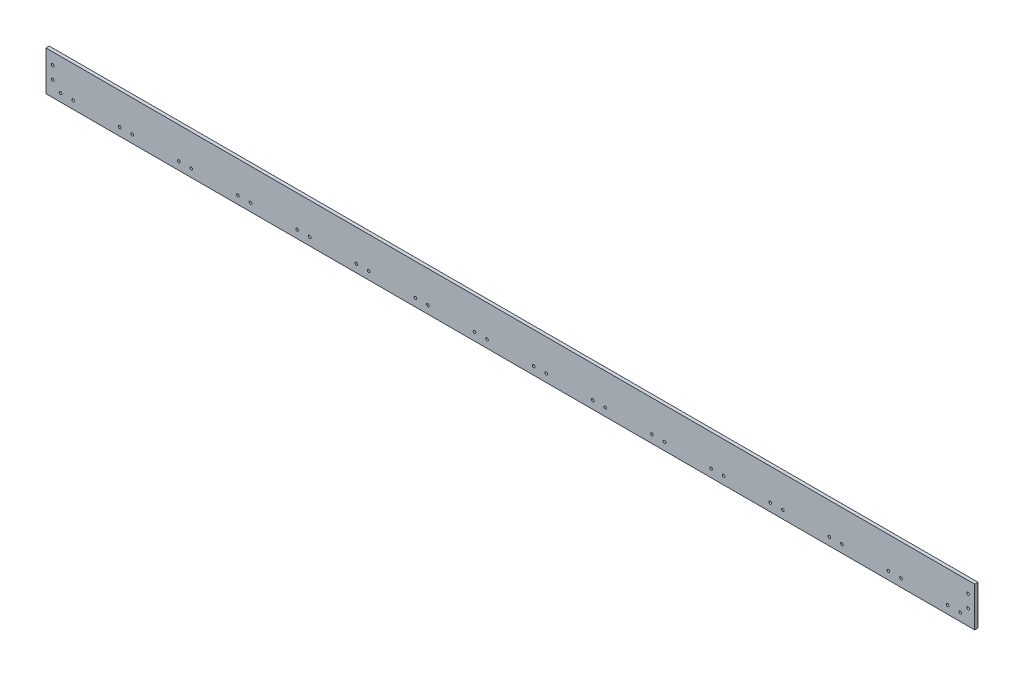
ISO-10303-21;
HEADER;
FILE_DESCRIPTION(('STEP AP214'),'2;1');
FILE_NAME('part.step','',(''),(''),'','','');
FILE_SCHEMA(('AUTOMOTIVE_DESIGN { 1 0 10303 214 1 1 1 1 }'));
ENDSEC;
DATA;
#1=APPLICATION_CONTEXT('core data for automotive mechanical design processes');
#2=APPLICATION_PROTOCOL_DEFINITION('international standard','automotive_design',2000,#1);
#3=PRODUCT_CONTEXT('',#1,'mechanical');
#4=PRODUCT('Part','Part','',(#3));
#5=PRODUCT_RELATED_PRODUCT_CATEGORY('part','',(#4));
#6=PRODUCT_DEFINITION_FORMATION('','',#4);
#7=PRODUCT_DEFINITION_CONTEXT('part definition',#1,'design');
#8=PRODUCT_DEFINITION('design','',#6,#7);
#9=PRODUCT_DEFINITION_SHAPE('','',#8);
#10=(LENGTH_UNIT() NAMED_UNIT(*) SI_UNIT(.MILLI.,.METRE.));
#11=(NAMED_UNIT(*) PLANE_ANGLE_UNIT() SI_UNIT($,.RADIAN.));
#12=(NAMED_UNIT(*) SI_UNIT($,.STERADIAN.) SOLID_ANGLE_UNIT());
#13=UNCERTAINTY_MEASURE_WITH_UNIT(LENGTH_MEASURE(1.E-05),#10,'distance_accuracy_value','');
#14=(GEOMETRIC_REPRESENTATION_CONTEXT(3) GLOBAL_UNCERTAINTY_ASSIGNED_CONTEXT((#13)) GLOBAL_UNIT_ASSIGNED_CONTEXT((#10,
#11,#12)) REPRESENTATION_CONTEXT('',''));
#15=CARTESIAN_POINT('',(0.,0.,0.));
#16=DIRECTION('',(0.,0.,1.));
#17=DIRECTION('',(1.,0.,0.));
#18=AXIS2_PLACEMENT_3D('',#15,#16,#17);
#19=CARTESIAN_POINT('',(0.,0.,6.35));
#20=DIRECTION('',(1.,0.,0.));
#21=DIRECTION('',(0.,1.,0.));
#22=AXIS2_PLACEMENT_3D('',#19,#20,#21);
#23=PLANE('',#22);
#24=DIRECTION('',(0.,-1.,0.));
#25=VECTOR('',#24,1.);
#26=CARTESIAN_POINT('',(0.,0.,0.));
#27=LINE('',#26,#25);
#28=CARTESIAN_POINT('',(0.,76.2,0.));
#29=VERTEX_POINT('',#28);
#30=CARTESIAN_POINT('',(0.,0.,0.));
#31=VERTEX_POINT('',#30);
#32=EDGE_CURVE('E98',#29,#31,#27,.T.);
#33=ORIENTED_EDGE('',*,*,#32,.T.);
#34=DIRECTION('',(0.,0.,-1.));
#35=VECTOR('',#34,1.);
#36=CARTESIAN_POINT('',(0.,0.,6.35));
#37=LINE('',#36,#35);
#38=CARTESIAN_POINT('',(0.,0.,6.35));
#39=VERTEX_POINT('',#38);
#40=EDGE_CURVE('E11',#39,#31,#37,.T.);
#41=ORIENTED_EDGE('',*,*,#40,.F.);
#42=DIRECTION('',(0.,-1.,0.));
#43=VECTOR('',#42,1.);
#44=CARTESIAN_POINT('',(0.,0.,6.35));
#45=LINE('',#44,#43);
#46=CARTESIAN_POINT('',(0.,76.2,6.35));
#47=VERTEX_POINT('',#46);
#48=EDGE_CURVE('E86',#47,#39,#45,.T.);
#49=ORIENTED_EDGE('',*,*,#48,.F.);
#50=DIRECTION('',(0.,0.,-1.));
#51=VECTOR('',#50,1.);
#52=CARTESIAN_POINT('',(0.,76.2,6.35));
#53=LINE('',#52,#51);
#54=EDGE_CURVE('E94',#47,#29,#53,.T.);
#55=ORIENTED_EDGE('',*,*,#54,.T.);
#56=EDGE_LOOP('',(#33,#41,#49,#55));
#57=FACE_BOUND('',#56,.T.);
#58=ADVANCED_FACE('F35',(#57),#23,.F.);
#59=CARTESIAN_POINT('',(0.,0.,6.35));
#60=DIRECTION('',(0.,1.,0.));
#61=DIRECTION('',(0.,0.,1.));
#62=AXIS2_PLACEMENT_3D('',#59,#60,#61);
#63=PLANE('',#62);
#64=DIRECTION('',(1.,0.,0.));
#65=VECTOR('',#64,1.);
#66=CARTESIAN_POINT('',(0.,0.,0.));
#67=LINE('',#66,#65);
#68=CARTESIAN_POINT('',(1784.35,0.,0.));
#69=VERTEX_POINT('',#68);
#70=EDGE_CURVE('E90',#31,#69,#67,.T.);
#71=ORIENTED_EDGE('',*,*,#70,.T.);
#72=DIRECTION('',(0.,0.,-1.));
#73=VECTOR('',#72,1.);
#74=CARTESIAN_POINT('',(1784.35,0.,6.35));
#75=LINE('',#74,#73);
#76=CARTESIAN_POINT('',(1784.35,0.,6.35));
#77=VERTEX_POINT('',#76);
#78=EDGE_CURVE('E43',#77,#69,#75,.T.);
#79=ORIENTED_EDGE('',*,*,#78,.F.);
#80=DIRECTION('',(1.,0.,0.));
#81=VECTOR('',#80,1.);
#82=CARTESIAN_POINT('',(0.,0.,6.35));
#83=LINE('',#82,#81);
#84=EDGE_CURVE('E81',#39,#77,#83,.T.);
#85=ORIENTED_EDGE('',*,*,#84,.F.);
#86=ORIENTED_EDGE('',*,*,#40,.T.);
#87=EDGE_LOOP('',(#71,#79,#85,#86));
#88=FACE_BOUND('',#87,.T.);
#89=ADVANCED_FACE('F89',(#88),#63,.F.);
#90=CARTESIAN_POINT('',(1784.35,0.,6.35));
#91=DIRECTION('',(-1.,0.,0.));
#92=DIRECTION('',(0.,0.,1.));
#93=AXIS2_PLACEMENT_3D('',#90,#91,#92);
#94=PLANE('',#93);
#95=DIRECTION('',(0.,1.,0.));
#96=VECTOR('',#95,1.);
#97=CARTESIAN_POINT('',(1784.35,0.,0.));
#98=LINE('',#97,#96);
#99=CARTESIAN_POINT('',(1784.35,76.2,0.));
#100=VERTEX_POINT('',#99);
#101=EDGE_CURVE('E68',#69,#100,#98,.T.);
#102=ORIENTED_EDGE('',*,*,#101,.T.);
#103=DIRECTION('',(0.,0.,-1.));
#104=VECTOR('',#103,1.);
#105=CARTESIAN_POINT('',(1784.35,76.2,6.35));
#106=LINE('',#105,#104);
#107=CARTESIAN_POINT('',(1784.35,76.2,6.35));
#108=VERTEX_POINT('',#107);
#109=EDGE_CURVE('E91',#108,#100,#106,.T.);
#110=ORIENTED_EDGE('',*,*,#109,.F.);
#111=DIRECTION('',(0.,1.,0.));
#112=VECTOR('',#111,1.);
#113=CARTESIAN_POINT('',(1784.35,0.,6.35));
#114=LINE('',#113,#112);
#115=EDGE_CURVE('E84',#77,#108,#114,.T.);
#116=ORIENTED_EDGE('',*,*,#115,.F.);
#117=ORIENTED_EDGE('',*,*,#78,.T.);
#118=EDGE_LOOP('',(#102,#110,#116,#117));
#119=FACE_BOUND('',#118,.T.);
#120=ADVANCED_FACE('F92',(#119),#94,.F.);
#121=CARTESIAN_POINT('',(0.,76.2,6.35));
#122=DIRECTION('',(0.,-1.,0.));
#123=DIRECTION('',(0.,0.,-1.));
#124=AXIS2_PLACEMENT_3D('',#121,#122,#123);
#125=PLANE('',#124);
#126=DIRECTION('',(-1.,0.,0.));
#127=VECTOR('',#126,1.);
#128=CARTESIAN_POINT('',(0.,76.2,0.));
#129=LINE('',#128,#127);
#130=EDGE_CURVE('E74',#100,#29,#129,.T.);
#131=ORIENTED_EDGE('',*,*,#130,.T.);
#132=ORIENTED_EDGE('',*,*,#54,.F.);
#133=DIRECTION('',(-1.,0.,0.));
#134=VECTOR('',#133,1.);
#135=CARTESIAN_POINT('',(0.,76.2,6.35));
#136=LINE('',#135,#134);
#137=EDGE_CURVE('E51',#108,#47,#136,.T.);
#138=ORIENTED_EDGE('',*,*,#137,.F.);
#139=ORIENTED_EDGE('',*,*,#109,.T.);
#140=EDGE_LOOP('',(#131,#132,#138,#139));
#141=FACE_BOUND('',#140,.T.);
#142=ADVANCED_FACE('F106',(#141),#125,.F.);
#143=CARTESIAN_POINT('',(0.,0.,6.35));
#144=DIRECTION('',(0.,0.,-1.));
#145=DIRECTION('',(-1.,0.,0.));
#146=AXIS2_PLACEMENT_3D('',#143,#144,#145);
#147=PLANE('',#146);
#148=CARTESIAN_POINT('',(1732.28,15.24,6.35));
#149=DIRECTION('',(0.,0.,1.));
#150=DIRECTION('',(1.,0.,0.));
#151=AXIS2_PLACEMENT_3D('',#148,#149,#150);
#152=CIRCLE('',#151,2.54000000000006);
#153=CARTESIAN_POINT('',(1734.82,15.24,6.35));
#154=VERTEX_POINT('',#153);
#155=EDGE_CURVE('E242',#154,#154,#152,.T.);
#156=ORIENTED_EDGE('',*,*,#155,.F.);
#157=EDGE_LOOP('',(#156));
#158=FACE_BOUND('',#157,.T.);
#159=CARTESIAN_POINT('',(1756.41,15.24,6.35));
#160=DIRECTION('',(0.,0.,1.));
#161=DIRECTION('',(1.,0.,0.));
#162=AXIS2_PLACEMENT_3D('',#159,#160,#161);
#163=CIRCLE('',#162,2.54000000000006);
#164=CARTESIAN_POINT('',(1758.95,15.24,6.35));
#165=VERTEX_POINT('',#164);
#166=EDGE_CURVE('E241',#165,#165,#163,.T.);
#167=ORIENTED_EDGE('',*,*,#166,.F.);
#168=EDGE_LOOP('',(#167));
#169=FACE_BOUND('',#168,.T.);
#170=CARTESIAN_POINT('',(1618.65733333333,15.24,6.35));
#171=DIRECTION('',(0.,0.,1.));
#172=DIRECTION('',(1.,0.,0.));
#173=AXIS2_PLACEMENT_3D('',#170,#171,#172);
#174=CIRCLE('',#173,2.54000000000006);
#175=CARTESIAN_POINT('',(1621.19733333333,15.24,6.35));
#176=VERTEX_POINT('',#175);
#177=EDGE_CURVE('E248',#176,#176,#174,.T.);
#178=ORIENTED_EDGE('',*,*,#177,.F.);
#179=EDGE_LOOP('',(#178));
#180=FACE_BOUND('',#179,.T.);
#181=CARTESIAN_POINT('',(1642.78733333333,15.24,6.35));
#182=DIRECTION('',(0.,0.,1.));
#183=DIRECTION('',(1.,0.,0.));
#184=AXIS2_PLACEMENT_3D('',#181,#182,#183);
#185=CIRCLE('',#184,2.54000000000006);
#186=CARTESIAN_POINT('',(1645.32733333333,15.24,6.35));
#187=VERTEX_POINT('',#186);
#188=EDGE_CURVE('E254',#187,#187,#185,.T.);
#189=ORIENTED_EDGE('',*,*,#188,.F.);
#190=EDGE_LOOP('',(#189));
#191=FACE_BOUND('',#190,.T.);
#192=CARTESIAN_POINT('',(1505.03466666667,15.24,6.35));
#193=DIRECTION('',(0.,0.,1.));
#194=DIRECTION('',(1.,0.,0.));
#195=AXIS2_PLACEMENT_3D('',#192,#193,#194);
#196=CIRCLE('',#195,2.54000000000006);
#197=CARTESIAN_POINT('',(1507.57466666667,15.24,6.35));
#198=VERTEX_POINT('',#197);
#199=EDGE_CURVE('E260',#198,#198,#196,.T.);
#200=ORIENTED_EDGE('',*,*,#199,.F.);
#201=EDGE_LOOP('',(#200));
#202=FACE_BOUND('',#201,.T.);
#203=CARTESIAN_POINT('',(1529.16466666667,15.24,6.35));
#204=DIRECTION('',(0.,0.,1.));
#205=DIRECTION('',(1.,0.,0.));
#206=AXIS2_PLACEMENT_3D('',#203,#204,#205);
#207=CIRCLE('',#206,2.54000000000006);
#208=CARTESIAN_POINT('',(1531.70466666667,15.24,6.35));
#209=VERTEX_POINT('',#208);
#210=EDGE_CURVE('E266',#209,#209,#207,.T.);
#211=ORIENTED_EDGE('',*,*,#210,.F.);
#212=EDGE_LOOP('',(#211));
#213=FACE_BOUND('',#212,.T.);
#214=CARTESIAN_POINT('',(1391.412,15.24,6.35));
#215=DIRECTION('',(0.,0.,1.));
#216=DIRECTION('',(1.,0.,0.));
#217=AXIS2_PLACEMENT_3D('',#214,#215,#216);
#218=CIRCLE('',#217,2.54000000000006);
#219=CARTESIAN_POINT('',(1393.952,15.24,6.35));
#220=VERTEX_POINT('',#219);
#221=EDGE_CURVE('E272',#220,#220,#218,.T.);
#222=ORIENTED_EDGE('',*,*,#221,.F.);
#223=EDGE_LOOP('',(#222));
#224=FACE_BOUND('',#223,.T.);
#225=CARTESIAN_POINT('',(1415.542,15.24,6.35));
#226=DIRECTION('',(0.,0.,1.));
#227=DIRECTION('',(1.,0.,0.));
#228=AXIS2_PLACEMENT_3D('',#225,#226,#227);
#229=CIRCLE('',#228,2.54000000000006);
#230=CARTESIAN_POINT('',(1418.082,15.24,6.35));
#231=VERTEX_POINT('',#230);
#232=EDGE_CURVE('E278',#231,#231,#229,.T.);
#233=ORIENTED_EDGE('',*,*,#232,.F.);
#234=EDGE_LOOP('',(#233));
#235=FACE_BOUND('',#234,.T.);
#236=CARTESIAN_POINT('',(1277.78933333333,15.24,6.35));
#237=DIRECTION('',(0.,0.,1.));
#238=DIRECTION('',(1.,0.,0.));
#239=AXIS2_PLACEMENT_3D('',#236,#237,#238);
#240=CIRCLE('',#239,2.54000000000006);
#241=CARTESIAN_POINT('',(1280.32933333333,15.24,6.35));
#242=VERTEX_POINT('',#241);
#243=EDGE_CURVE('E284',#242,#242,#240,.T.);
#244=ORIENTED_EDGE('',*,*,#243,.F.);
#245=EDGE_LOOP('',(#244));
#246=FACE_BOUND('',#245,.T.);
#247=CARTESIAN_POINT('',(1301.91933333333,15.24,6.35));
#248=DIRECTION('',(0.,0.,1.));
#249=DIRECTION('',(1.,0.,0.));
#250=AXIS2_PLACEMENT_3D('',#247,#248,#249);
#251=CIRCLE('',#250,2.54000000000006);
#252=CARTESIAN_POINT('',(1304.45933333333,15.24,6.35));
#253=VERTEX_POINT('',#252);
#254=EDGE_CURVE('E290',#253,#253,#251,.T.);
#255=ORIENTED_EDGE('',*,*,#254,.F.);
#256=EDGE_LOOP('',(#255));
#257=FACE_BOUND('',#256,.T.);
#258=CARTESIAN_POINT('',(1164.16666666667,15.24,6.35));
#259=DIRECTION('',(0.,0.,1.));
#260=DIRECTION('',(1.,0.,0.));
#261=AXIS2_PLACEMENT_3D('',#258,#259,#260);
#262=CIRCLE('',#261,2.54000000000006);
#263=CARTESIAN_POINT('',(1166.70666666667,15.24,6.35));
#264=VERTEX_POINT('',#263);
#265=EDGE_CURVE('E296',#264,#264,#262,.T.);
#266=ORIENTED_EDGE('',*,*,#265,.F.);
#267=EDGE_LOOP('',(#266));
#268=FACE_BOUND('',#267,.T.);
#269=CARTESIAN_POINT('',(1188.29666666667,15.24,6.35));
#270=DIRECTION('',(0.,0.,1.));
#271=DIRECTION('',(1.,0.,0.));
#272=AXIS2_PLACEMENT_3D('',#269,#270,#271);
#273=CIRCLE('',#272,2.54000000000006);
#274=CARTESIAN_POINT('',(1190.83666666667,15.24,6.35));
#275=VERTEX_POINT('',#274);
#276=EDGE_CURVE('E302',#275,#275,#273,.T.);
#277=ORIENTED_EDGE('',*,*,#276,.F.);
#278=EDGE_LOOP('',(#277));
#279=FACE_BOUND('',#278,.T.);
#280=CARTESIAN_POINT('',(1050.544,15.24,6.35));
#281=DIRECTION('',(0.,0.,1.));
#282=DIRECTION('',(1.,0.,0.));
#283=AXIS2_PLACEMENT_3D('',#280,#281,#282);
#284=CIRCLE('',#283,2.54000000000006);
#285=CARTESIAN_POINT('',(1053.084,15.24,6.35));
#286=VERTEX_POINT('',#285);
#287=EDGE_CURVE('E308',#286,#286,#284,.T.);
#288=ORIENTED_EDGE('',*,*,#287,.F.);
#289=EDGE_LOOP('',(#288));
#290=FACE_BOUND('',#289,.T.);
#291=CARTESIAN_POINT('',(1074.674,15.24,6.35));
#292=DIRECTION('',(0.,0.,1.));
#293=DIRECTION('',(1.,0.,0.));
#294=AXIS2_PLACEMENT_3D('',#291,#292,#293);
#295=CIRCLE('',#294,2.54000000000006);
#296=CARTESIAN_POINT('',(1077.214,15.24,6.35));
#297=VERTEX_POINT('',#296);
#298=EDGE_CURVE('E314',#297,#297,#295,.T.);
#299=ORIENTED_EDGE('',*,*,#298,.F.);
#300=EDGE_LOOP('',(#299));
#301=FACE_BOUND('',#300,.T.);
#302=CARTESIAN_POINT('',(936.921333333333,15.24,6.35));
#303=DIRECTION('',(0.,0.,1.));
#304=DIRECTION('',(1.,0.,0.));
#305=AXIS2_PLACEMENT_3D('',#302,#303,#304);
#306=CIRCLE('',#305,2.54000000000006);
#307=CARTESIAN_POINT('',(939.461333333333,15.24,6.35));
#308=VERTEX_POINT('',#307);
#309=EDGE_CURVE('E320',#308,#308,#306,.T.);
#310=ORIENTED_EDGE('',*,*,#309,.F.);
#311=EDGE_LOOP('',(#310));
#312=FACE_BOUND('',#311,.T.);
#313=CARTESIAN_POINT('',(733.806,15.24,6.35));
#314=DIRECTION('',(0.,0.,1.));
#315=DIRECTION('',(1.,0.,0.));
#316=AXIS2_PLACEMENT_3D('',#313,#314,#315);
#317=CIRCLE('',#316,2.54000000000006);
#318=CARTESIAN_POINT('',(736.346,15.24,6.35));
#319=VERTEX_POINT('',#318);
#320=EDGE_CURVE('E166',#319,#319,#317,.T.);
#321=ORIENTED_EDGE('',*,*,#320,.F.);
#322=EDGE_LOOP('',(#321));
#323=FACE_BOUND('',#322,.T.);
#324=CARTESIAN_POINT('',(596.053333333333,15.24,6.35));
#325=DIRECTION('',(0.,0.,1.));
#326=DIRECTION('',(1.,0.,0.));
#327=AXIS2_PLACEMENT_3D('',#324,#325,#326);
#328=CIRCLE('',#327,2.54000000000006);
#329=CARTESIAN_POINT('',(598.593333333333,15.24,6.35));
#330=VERTEX_POINT('',#329);
#331=EDGE_CURVE('E165',#330,#330,#328,.T.);
#332=ORIENTED_EDGE('',*,*,#331,.F.);
#333=EDGE_LOOP('',(#332));
#334=FACE_BOUND('',#333,.T.);
#335=CARTESIAN_POINT('',(620.183333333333,15.24,6.35));
#336=DIRECTION('',(0.,0.,1.));
#337=DIRECTION('',(1.,0.,0.));
#338=AXIS2_PLACEMENT_3D('',#335,#336,#337);
#339=CIRCLE('',#338,2.54000000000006);
#340=CARTESIAN_POINT('',(622.723333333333,15.24,6.35));
#341=VERTEX_POINT('',#340);
#342=EDGE_CURVE('E158',#341,#341,#339,.T.);
#343=ORIENTED_EDGE('',*,*,#342,.F.);
#344=EDGE_LOOP('',(#343));
#345=FACE_BOUND('',#344,.T.);
#346=CARTESIAN_POINT('',(961.051333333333,15.24,6.35));
#347=DIRECTION('',(0.,0.,1.));
#348=DIRECTION('',(1.,0.,0.));
#349=AXIS2_PLACEMENT_3D('',#346,#347,#348);
#350=CIRCLE('',#349,2.54000000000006);
#351=CARTESIAN_POINT('',(963.591333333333,15.24,6.35));
#352=VERTEX_POINT('',#351);
#353=EDGE_CURVE('E190',#352,#352,#350,.T.);
#354=ORIENTED_EDGE('',*,*,#353,.F.);
#355=EDGE_LOOP('',(#354));
#356=FACE_BOUND('',#355,.T.);
#357=CARTESIAN_POINT('',(823.298666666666,15.24,6.35));
#358=DIRECTION('',(0.,0.,1.));
#359=DIRECTION('',(1.,0.,0.));
#360=AXIS2_PLACEMENT_3D('',#357,#358,#359);
#361=CIRCLE('',#360,2.54000000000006);
#362=CARTESIAN_POINT('',(825.838666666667,15.24,6.35));
#363=VERTEX_POINT('',#362);
#364=EDGE_CURVE('E189',#363,#363,#361,.T.);
#365=ORIENTED_EDGE('',*,*,#364,.F.);
#366=EDGE_LOOP('',(#365));
#367=FACE_BOUND('',#366,.T.);
#368=CARTESIAN_POINT('',(847.428666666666,15.24,6.35));
#369=DIRECTION('',(0.,0.,1.));
#370=DIRECTION('',(1.,0.,0.));
#371=AXIS2_PLACEMENT_3D('',#368,#369,#370);
#372=CIRCLE('',#371,2.54000000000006);
#373=CARTESIAN_POINT('',(849.968666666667,15.24,6.35));
#374=VERTEX_POINT('',#373);
#375=EDGE_CURVE('E178',#374,#374,#372,.T.);
#376=ORIENTED_EDGE('',*,*,#375,.F.);
#377=EDGE_LOOP('',(#376));
#378=FACE_BOUND('',#377,.T.);
#379=CARTESIAN_POINT('',(709.676,15.24,6.35));
#380=DIRECTION('',(0.,0.,1.));
#381=DIRECTION('',(1.,0.,0.));
#382=AXIS2_PLACEMENT_3D('',#379,#380,#381);
#383=CIRCLE('',#382,2.54000000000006);
#384=CARTESIAN_POINT('',(712.216,15.24,6.35));
#385=VERTEX_POINT('',#384);
#386=EDGE_CURVE('E177',#385,#385,#383,.T.);
#387=ORIENTED_EDGE('',*,*,#386,.F.);
#388=EDGE_LOOP('',(#387));
#389=FACE_BOUND('',#388,.T.);
#390=CARTESIAN_POINT('',(482.430666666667,15.24,6.35));
#391=DIRECTION('',(0.,0.,1.));
#392=DIRECTION('',(1.,0.,0.));
#393=AXIS2_PLACEMENT_3D('',#390,#391,#392);
#394=CIRCLE('',#393,2.54000000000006);
#395=CARTESIAN_POINT('',(484.970666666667,15.24,6.35));
#396=VERTEX_POINT('',#395);
#397=EDGE_CURVE('E157',#396,#396,#394,.T.);
#398=ORIENTED_EDGE('',*,*,#397,.F.);
#399=EDGE_LOOP('',(#398));
#400=FACE_BOUND('',#399,.T.);
#401=CARTESIAN_POINT('',(506.560666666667,15.24,6.35));
#402=DIRECTION('',(0.,0.,1.));
#403=DIRECTION('',(1.,0.,0.));
#404=AXIS2_PLACEMENT_3D('',#401,#402,#403);
#405=CIRCLE('',#404,2.54000000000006);
#406=CARTESIAN_POINT('',(509.100666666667,15.24,6.35));
#407=VERTEX_POINT('',#406);
#408=EDGE_CURVE('E201',#407,#407,#405,.T.);
#409=ORIENTED_EDGE('',*,*,#408,.F.);
#410=EDGE_LOOP('',(#409));
#411=FACE_BOUND('',#410,.T.);
#412=CARTESIAN_POINT('',(368.808,15.24,6.35));
#413=DIRECTION('',(0.,0.,1.));
#414=DIRECTION('',(1.,0.,0.));
#415=AXIS2_PLACEMENT_3D('',#412,#413,#414);
#416=CIRCLE('',#415,2.54000000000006);
#417=CARTESIAN_POINT('',(371.348,15.24,6.35));
#418=VERTEX_POINT('',#417);
#419=EDGE_CURVE('E207',#418,#418,#416,.T.);
#420=ORIENTED_EDGE('',*,*,#419,.F.);
#421=EDGE_LOOP('',(#420));
#422=FACE_BOUND('',#421,.T.);
#423=CARTESIAN_POINT('',(392.938,15.24,6.35));
#424=DIRECTION('',(0.,0.,1.));
#425=DIRECTION('',(1.,0.,0.));
#426=AXIS2_PLACEMENT_3D('',#423,#424,#425);
#427=CIRCLE('',#426,2.54000000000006);
#428=CARTESIAN_POINT('',(395.478,15.24,6.35));
#429=VERTEX_POINT('',#428);
#430=EDGE_CURVE('E213',#429,#429,#427,.T.);
#431=ORIENTED_EDGE('',*,*,#430,.F.);
#432=EDGE_LOOP('',(#431));
#433=FACE_BOUND('',#432,.T.);
#434=CARTESIAN_POINT('',(255.185333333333,15.24,6.35));
#435=DIRECTION('',(0.,0.,1.));
#436=DIRECTION('',(1.,0.,0.));
#437=AXIS2_PLACEMENT_3D('',#434,#435,#436);
#438=CIRCLE('',#437,2.54000000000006);
#439=CARTESIAN_POINT('',(257.725333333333,15.24,6.35));
#440=VERTEX_POINT('',#439);
#441=EDGE_CURVE('E219',#440,#440,#438,.T.);
#442=ORIENTED_EDGE('',*,*,#441,.F.);
#443=EDGE_LOOP('',(#442));
#444=FACE_BOUND('',#443,.T.);
#445=CARTESIAN_POINT('',(279.315333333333,15.24,6.35));
#446=DIRECTION('',(0.,0.,1.));
#447=DIRECTION('',(1.,0.,0.));
#448=AXIS2_PLACEMENT_3D('',#445,#446,#447);
#449=CIRCLE('',#448,2.54000000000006);
#450=CARTESIAN_POINT('',(281.855333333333,15.24,6.35));
#451=VERTEX_POINT('',#450);
#452=EDGE_CURVE('E225',#451,#451,#449,.T.);
#453=ORIENTED_EDGE('',*,*,#452,.F.);
#454=EDGE_LOOP('',(#453));
#455=FACE_BOUND('',#454,.T.);
#456=CARTESIAN_POINT('',(141.562666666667,15.24,6.35));
#457=DIRECTION('',(0.,0.,1.));
#458=DIRECTION('',(1.,0.,0.));
#459=AXIS2_PLACEMENT_3D('',#456,#457,#458);
#460=CIRCLE('',#459,2.54000000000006);
#461=CARTESIAN_POINT('',(144.102666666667,15.24,6.35));
#462=VERTEX_POINT('',#461);
#463=EDGE_CURVE('E231',#462,#462,#460,.T.);
#464=ORIENTED_EDGE('',*,*,#463,.F.);
#465=EDGE_LOOP('',(#464));
#466=FACE_BOUND('',#465,.T.);
#467=CARTESIAN_POINT('',(165.692666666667,15.24,6.35));
#468=DIRECTION('',(0.,0.,1.));
#469=DIRECTION('',(1.,0.,0.));
#470=AXIS2_PLACEMENT_3D('',#467,#468,#469);
#471=CIRCLE('',#470,2.54000000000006);
#472=CARTESIAN_POINT('',(168.232666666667,15.24,6.35));
#473=VERTEX_POINT('',#472);
#474=EDGE_CURVE('E150',#473,#473,#471,.T.);
#475=ORIENTED_EDGE('',*,*,#474,.F.);
#476=EDGE_LOOP('',(#475));
#477=FACE_BOUND('',#476,.T.);
#478=CARTESIAN_POINT('',(12.7,53.975,6.35));
#479=DIRECTION('',(0.,0.,1.));
#480=DIRECTION('',(1.,0.,0.));
#481=AXIS2_PLACEMENT_3D('',#478,#479,#480);
#482=CIRCLE('',#481,2.54);
#483=CARTESIAN_POINT('',(15.24,53.975,6.35));
#484=VERTEX_POINT('',#483);
#485=EDGE_CURVE('E141',#484,#484,#482,.T.);
#486=ORIENTED_EDGE('',*,*,#485,.F.);
#487=EDGE_LOOP('',(#486));
#488=FACE_BOUND('',#487,.T.);
#489=CARTESIAN_POINT('',(1771.65,29.8450000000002,6.35));
#490=DIRECTION('',(0.,0.,1.));
#491=DIRECTION('',(-1.,0.,0.));
#492=AXIS2_PLACEMENT_3D('',#489,#490,#491);
#493=CIRCLE('',#492,2.54000000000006);
#494=CARTESIAN_POINT('',(1769.11,29.8450000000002,6.35));
#495=VERTEX_POINT('',#494);
#496=EDGE_CURVE('E133',#495,#495,#493,.T.);
#497=ORIENTED_EDGE('',*,*,#496,.F.);
#498=EDGE_LOOP('',(#497));
#499=FACE_BOUND('',#498,.T.);
#500=CARTESIAN_POINT('',(1771.65,53.9750000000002,6.35));
#501=DIRECTION('',(0.,0.,1.));
#502=DIRECTION('',(-1.,0.,0.));
#503=AXIS2_PLACEMENT_3D('',#500,#501,#502);
#504=CIRCLE('',#503,2.54000000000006);
#505=CARTESIAN_POINT('',(1769.11,53.9750000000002,6.35));
#506=VERTEX_POINT('',#505);
#507=EDGE_CURVE('E134',#506,#506,#504,.T.);
#508=ORIENTED_EDGE('',*,*,#507,.F.);
#509=EDGE_LOOP('',(#508));
#510=FACE_BOUND('',#509,.T.);
#511=CARTESIAN_POINT('',(12.7,29.845,6.35));
#512=DIRECTION('',(0.,0.,1.));
#513=DIRECTION('',(1.,0.,0.));
#514=AXIS2_PLACEMENT_3D('',#511,#512,#513);
#515=CIRCLE('',#514,2.54);
#516=CARTESIAN_POINT('',(15.24,29.845,6.35));
#517=VERTEX_POINT('',#516);
#518=EDGE_CURVE('E126',#517,#517,#515,.T.);
#519=ORIENTED_EDGE('',*,*,#518,.F.);
#520=EDGE_LOOP('',(#519));
#521=FACE_BOUND('',#520,.T.);
#522=CARTESIAN_POINT('',(27.94,15.24,6.35));
#523=DIRECTION('',(0.,0.,1.));
#524=DIRECTION('',(1.,0.,0.));
#525=AXIS2_PLACEMENT_3D('',#522,#523,#524);
#526=CIRCLE('',#525,2.54000000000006);
#527=CARTESIAN_POINT('',(30.48,15.24,6.35));
#528=VERTEX_POINT('',#527);
#529=EDGE_CURVE('E117',#528,#528,#526,.T.);
#530=ORIENTED_EDGE('',*,*,#529,.F.);
#531=EDGE_LOOP('',(#530));
#532=FACE_BOUND('',#531,.T.);
#533=CARTESIAN_POINT('',(52.07,15.24,6.35));
#534=DIRECTION('',(0.,0.,1.));
#535=DIRECTION('',(1.,0.,0.));
#536=AXIS2_PLACEMENT_3D('',#533,#534,#535);
#537=CIRCLE('',#536,2.54000000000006);
#538=CARTESIAN_POINT('',(54.6100000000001,15.24,6.35));
#539=VERTEX_POINT('',#538);
#540=EDGE_CURVE('E114',#539,#539,#537,.T.);
#541=ORIENTED_EDGE('',*,*,#540,.F.);
#542=EDGE_LOOP('',(#541));
#543=FACE_BOUND('',#542,.T.);
#544=ORIENTED_EDGE('',*,*,#48,.T.);
#545=ORIENTED_EDGE('',*,*,#84,.T.);
#546=ORIENTED_EDGE('',*,*,#115,.T.);
#547=ORIENTED_EDGE('',*,*,#137,.T.);
#548=EDGE_LOOP('',(#544,#545,#546,#547));
#549=FACE_BOUND('',#548,.T.);
#550=ADVANCED_FACE('F82',(#158,#169,#180,#191,#202,#213,#224,#235,#246,#257,#268,#279,#290,#301,
#312,#323,#334,#345,#356,#367,#378,#389,#400,#411,#422,#433,#444,#455,#466,#477,#488,#499,#510,
#521,#532,#543,#549),#147,.F.);
#551=CARTESIAN_POINT('',(0.,0.,0.));
#552=DIRECTION('',(0.,0.,-1.));
#553=DIRECTION('',(-1.,0.,0.));
#554=AXIS2_PLACEMENT_3D('',#551,#552,#553);
#555=PLANE('',#554);
#556=CARTESIAN_POINT('',(1732.28,15.24,0.));
#557=DIRECTION('',(0.,0.,-1.));
#558=DIRECTION('',(-1.,0.,0.));
#559=AXIS2_PLACEMENT_3D('',#556,#557,#558);
#560=CIRCLE('',#559,2.54000000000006);
#561=CARTESIAN_POINT('',(1729.74,15.24,0.));
#562=VERTEX_POINT('',#561);
#563=EDGE_CURVE('E238',#562,#562,#560,.F.);
#564=ORIENTED_EDGE('',*,*,#563,.T.);
#565=EDGE_LOOP('',(#564));
#566=FACE_BOUND('',#565,.T.);
#567=CARTESIAN_POINT('',(1756.41,15.24,0.));
#568=DIRECTION('',(0.,0.,-1.));
#569=DIRECTION('',(-1.,0.,0.));
#570=AXIS2_PLACEMENT_3D('',#567,#568,#569);
#571=CIRCLE('',#570,2.54000000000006);
#572=CARTESIAN_POINT('',(1753.87,15.24,0.));
#573=VERTEX_POINT('',#572);
#574=EDGE_CURVE('E245',#573,#573,#571,.F.);
#575=ORIENTED_EDGE('',*,*,#574,.T.);
#576=EDGE_LOOP('',(#575));
#577=FACE_BOUND('',#576,.T.);
#578=CARTESIAN_POINT('',(1618.65733333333,15.24,0.));
#579=DIRECTION('',(0.,0.,-1.));
#580=DIRECTION('',(-1.,0.,0.));
#581=AXIS2_PLACEMENT_3D('',#578,#579,#580);
#582=CIRCLE('',#581,2.54000000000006);
#583=CARTESIAN_POINT('',(1616.11733333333,15.24,0.));
#584=VERTEX_POINT('',#583);
#585=EDGE_CURVE('E251',#584,#584,#582,.F.);
#586=ORIENTED_EDGE('',*,*,#585,.T.);
#587=EDGE_LOOP('',(#586));
#588=FACE_BOUND('',#587,.T.);
#589=CARTESIAN_POINT('',(1642.78733333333,15.24,0.));
#590=DIRECTION('',(0.,0.,-1.));
#591=DIRECTION('',(-1.,0.,0.));
#592=AXIS2_PLACEMENT_3D('',#589,#590,#591);
#593=CIRCLE('',#592,2.54000000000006);
#594=CARTESIAN_POINT('',(1640.24733333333,15.24,0.));
#595=VERTEX_POINT('',#594);
#596=EDGE_CURVE('E257',#595,#595,#593,.F.);
#597=ORIENTED_EDGE('',*,*,#596,.T.);
#598=EDGE_LOOP('',(#597));
#599=FACE_BOUND('',#598,.T.);
#600=CARTESIAN_POINT('',(1505.03466666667,15.24,0.));
#601=DIRECTION('',(0.,0.,-1.));
#602=DIRECTION('',(-1.,0.,0.));
#603=AXIS2_PLACEMENT_3D('',#600,#601,#602);
#604=CIRCLE('',#603,2.54000000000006);
#605=CARTESIAN_POINT('',(1502.49466666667,15.24,0.));
#606=VERTEX_POINT('',#605);
#607=EDGE_CURVE('E263',#606,#606,#604,.F.);
#608=ORIENTED_EDGE('',*,*,#607,.T.);
#609=EDGE_LOOP('',(#608));
#610=FACE_BOUND('',#609,.T.);
#611=CARTESIAN_POINT('',(1529.16466666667,15.24,0.));
#612=DIRECTION('',(0.,0.,-1.));
#613=DIRECTION('',(-1.,0.,0.));
#614=AXIS2_PLACEMENT_3D('',#611,#612,#613);
#615=CIRCLE('',#614,2.54000000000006);
#616=CARTESIAN_POINT('',(1526.62466666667,15.24,0.));
#617=VERTEX_POINT('',#616);
#618=EDGE_CURVE('E269',#617,#617,#615,.F.);
#619=ORIENTED_EDGE('',*,*,#618,.T.);
#620=EDGE_LOOP('',(#619));
#621=FACE_BOUND('',#620,.T.);
#622=CARTESIAN_POINT('',(1391.412,15.24,0.));
#623=DIRECTION('',(0.,0.,-1.));
#624=DIRECTION('',(-1.,0.,0.));
#625=AXIS2_PLACEMENT_3D('',#622,#623,#624);
#626=CIRCLE('',#625,2.54000000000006);
#627=CARTESIAN_POINT('',(1388.872,15.24,0.));
#628=VERTEX_POINT('',#627);
#629=EDGE_CURVE('E275',#628,#628,#626,.F.);
#630=ORIENTED_EDGE('',*,*,#629,.T.);
#631=EDGE_LOOP('',(#630));
#632=FACE_BOUND('',#631,.T.);
#633=CARTESIAN_POINT('',(1415.542,15.24,0.));
#634=DIRECTION('',(0.,0.,-1.));
#635=DIRECTION('',(-1.,0.,0.));
#636=AXIS2_PLACEMENT_3D('',#633,#634,#635);
#637=CIRCLE('',#636,2.54000000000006);
#638=CARTESIAN_POINT('',(1413.002,15.24,0.));
#639=VERTEX_POINT('',#638);
#640=EDGE_CURVE('E281',#639,#639,#637,.F.);
#641=ORIENTED_EDGE('',*,*,#640,.T.);
#642=EDGE_LOOP('',(#641));
#643=FACE_BOUND('',#642,.T.);
#644=CARTESIAN_POINT('',(1277.78933333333,15.24,0.));
#645=DIRECTION('',(0.,0.,-1.));
#646=DIRECTION('',(-1.,0.,0.));
#647=AXIS2_PLACEMENT_3D('',#644,#645,#646);
#648=CIRCLE('',#647,2.54000000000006);
#649=CARTESIAN_POINT('',(1275.24933333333,15.24,0.));
#650=VERTEX_POINT('',#649);
#651=EDGE_CURVE('E287',#650,#650,#648,.F.);
#652=ORIENTED_EDGE('',*,*,#651,.T.);
#653=EDGE_LOOP('',(#652));
#654=FACE_BOUND('',#653,.T.);
#655=CARTESIAN_POINT('',(1301.91933333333,15.24,0.));
#656=DIRECTION('',(0.,0.,-1.));
#657=DIRECTION('',(-1.,0.,0.));
#658=AXIS2_PLACEMENT_3D('',#655,#656,#657);
#659=CIRCLE('',#658,2.54000000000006);
#660=CARTESIAN_POINT('',(1299.37933333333,15.24,0.));
#661=VERTEX_POINT('',#660);
#662=EDGE_CURVE('E293',#661,#661,#659,.F.);
#663=ORIENTED_EDGE('',*,*,#662,.T.);
#664=EDGE_LOOP('',(#663));
#665=FACE_BOUND('',#664,.T.);
#666=CARTESIAN_POINT('',(1164.16666666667,15.24,0.));
#667=DIRECTION('',(0.,0.,-1.));
#668=DIRECTION('',(-1.,0.,0.));
#669=AXIS2_PLACEMENT_3D('',#666,#667,#668);
#670=CIRCLE('',#669,2.54000000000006);
#671=CARTESIAN_POINT('',(1161.62666666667,15.24,0.));
#672=VERTEX_POINT('',#671);
#673=EDGE_CURVE('E299',#672,#672,#670,.F.);
#674=ORIENTED_EDGE('',*,*,#673,.T.);
#675=EDGE_LOOP('',(#674));
#676=FACE_BOUND('',#675,.T.);
#677=CARTESIAN_POINT('',(1188.29666666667,15.24,0.));
#678=DIRECTION('',(0.,0.,-1.));
#679=DIRECTION('',(-1.,0.,0.));
#680=AXIS2_PLACEMENT_3D('',#677,#678,#679);
#681=CIRCLE('',#680,2.54000000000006);
#682=CARTESIAN_POINT('',(1185.75666666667,15.24,0.));
#683=VERTEX_POINT('',#682);
#684=EDGE_CURVE('E305',#683,#683,#681,.F.);
#685=ORIENTED_EDGE('',*,*,#684,.T.);
#686=EDGE_LOOP('',(#685));
#687=FACE_BOUND('',#686,.T.);
#688=CARTESIAN_POINT('',(1050.544,15.24,0.));
#689=DIRECTION('',(0.,0.,-1.));
#690=DIRECTION('',(-1.,0.,0.));
#691=AXIS2_PLACEMENT_3D('',#688,#689,#690);
#692=CIRCLE('',#691,2.54000000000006);
#693=CARTESIAN_POINT('',(1048.004,15.24,0.));
#694=VERTEX_POINT('',#693);
#695=EDGE_CURVE('E311',#694,#694,#692,.F.);
#696=ORIENTED_EDGE('',*,*,#695,.T.);
#697=EDGE_LOOP('',(#696));
#698=FACE_BOUND('',#697,.T.);
#699=CARTESIAN_POINT('',(1074.674,15.24,0.));
#700=DIRECTION('',(0.,0.,-1.));
#701=DIRECTION('',(-1.,0.,0.));
#702=AXIS2_PLACEMENT_3D('',#699,#700,#701);
#703=CIRCLE('',#702,2.54000000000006);
#704=CARTESIAN_POINT('',(1072.134,15.24,0.));
#705=VERTEX_POINT('',#704);
#706=EDGE_CURVE('E317',#705,#705,#703,.F.);
#707=ORIENTED_EDGE('',*,*,#706,.T.);
#708=EDGE_LOOP('',(#707));
#709=FACE_BOUND('',#708,.T.);
#710=CARTESIAN_POINT('',(936.921333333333,15.24,0.));
#711=DIRECTION('',(0.,0.,-1.));
#712=DIRECTION('',(-1.,0.,0.));
#713=AXIS2_PLACEMENT_3D('',#710,#711,#712);
#714=CIRCLE('',#713,2.54000000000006);
#715=CARTESIAN_POINT('',(934.381333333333,15.24,0.));
#716=VERTEX_POINT('',#715);
#717=EDGE_CURVE('E193',#716,#716,#714,.F.);
#718=ORIENTED_EDGE('',*,*,#717,.T.);
#719=EDGE_LOOP('',(#718));
#720=FACE_BOUND('',#719,.T.);
#721=CARTESIAN_POINT('',(733.806,15.24,0.));
#722=DIRECTION('',(0.,0.,-1.));
#723=DIRECTION('',(-1.,0.,0.));
#724=AXIS2_PLACEMENT_3D('',#721,#722,#723);
#725=CIRCLE('',#724,2.54000000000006);
#726=CARTESIAN_POINT('',(731.266,15.24,0.));
#727=VERTEX_POINT('',#726);
#728=EDGE_CURVE('E162',#727,#727,#725,.F.);
#729=ORIENTED_EDGE('',*,*,#728,.T.);
#730=EDGE_LOOP('',(#729));
#731=FACE_BOUND('',#730,.T.);
#732=CARTESIAN_POINT('',(596.053333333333,15.24,0.));
#733=DIRECTION('',(0.,0.,-1.));
#734=DIRECTION('',(-1.,0.,0.));
#735=AXIS2_PLACEMENT_3D('',#732,#733,#734);
#736=CIRCLE('',#735,2.54000000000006);
#737=CARTESIAN_POINT('',(593.513333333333,15.24,0.));
#738=VERTEX_POINT('',#737);
#739=EDGE_CURVE('E161',#738,#738,#736,.F.);
#740=ORIENTED_EDGE('',*,*,#739,.T.);
#741=EDGE_LOOP('',(#740));
#742=FACE_BOUND('',#741,.T.);
#743=CARTESIAN_POINT('',(620.183333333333,15.24,0.));
#744=DIRECTION('',(0.,0.,-1.));
#745=DIRECTION('',(-1.,0.,0.));
#746=AXIS2_PLACEMENT_3D('',#743,#744,#745);
#747=CIRCLE('',#746,2.54000000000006);
#748=CARTESIAN_POINT('',(617.643333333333,15.24,0.));
#749=VERTEX_POINT('',#748);
#750=EDGE_CURVE('E154',#749,#749,#747,.F.);
#751=ORIENTED_EDGE('',*,*,#750,.T.);
#752=EDGE_LOOP('',(#751));
#753=FACE_BOUND('',#752,.T.);
#754=CARTESIAN_POINT('',(961.051333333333,15.24,0.));
#755=DIRECTION('',(0.,0.,-1.));
#756=DIRECTION('',(-1.,0.,0.));
#757=AXIS2_PLACEMENT_3D('',#754,#755,#756);
#758=CIRCLE('',#757,2.54000000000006);
#759=CARTESIAN_POINT('',(958.511333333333,15.24,0.));
#760=VERTEX_POINT('',#759);
#761=EDGE_CURVE('E186',#760,#760,#758,.F.);
#762=ORIENTED_EDGE('',*,*,#761,.T.);
#763=EDGE_LOOP('',(#762));
#764=FACE_BOUND('',#763,.T.);
#765=CARTESIAN_POINT('',(823.298666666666,15.24,0.));
#766=DIRECTION('',(0.,0.,-1.));
#767=DIRECTION('',(-1.,0.,0.));
#768=AXIS2_PLACEMENT_3D('',#765,#766,#767);
#769=CIRCLE('',#768,2.54000000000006);
#770=CARTESIAN_POINT('',(820.758666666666,15.24,0.));
#771=VERTEX_POINT('',#770);
#772=EDGE_CURVE('E181',#771,#771,#769,.F.);
#773=ORIENTED_EDGE('',*,*,#772,.T.);
#774=EDGE_LOOP('',(#773));
#775=FACE_BOUND('',#774,.T.);
#776=CARTESIAN_POINT('',(847.428666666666,15.24,0.));
#777=DIRECTION('',(0.,0.,-1.));
#778=DIRECTION('',(-1.,0.,0.));
#779=AXIS2_PLACEMENT_3D('',#776,#777,#778);
#780=CIRCLE('',#779,2.54000000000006);
#781=CARTESIAN_POINT('',(844.888666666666,15.24,0.));
#782=VERTEX_POINT('',#781);
#783=EDGE_CURVE('E174',#782,#782,#780,.F.);
#784=ORIENTED_EDGE('',*,*,#783,.T.);
#785=EDGE_LOOP('',(#784));
#786=FACE_BOUND('',#785,.T.);
#787=CARTESIAN_POINT('',(709.676,15.24,0.));
#788=DIRECTION('',(0.,0.,-1.));
#789=DIRECTION('',(-1.,0.,0.));
#790=AXIS2_PLACEMENT_3D('',#787,#788,#789);
#791=CIRCLE('',#790,2.54000000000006);
#792=CARTESIAN_POINT('',(707.136,15.24,0.));
#793=VERTEX_POINT('',#792);
#794=EDGE_CURVE('E169',#793,#793,#791,.F.);
#795=ORIENTED_EDGE('',*,*,#794,.T.);
#796=EDGE_LOOP('',(#795));
#797=FACE_BOUND('',#796,.T.);
#798=CARTESIAN_POINT('',(482.430666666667,15.24,0.));
#799=DIRECTION('',(0.,0.,-1.));
#800=DIRECTION('',(-1.,0.,0.));
#801=AXIS2_PLACEMENT_3D('',#798,#799,#800);
#802=CIRCLE('',#801,2.54000000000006);
#803=CARTESIAN_POINT('',(479.890666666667,15.24,0.));
#804=VERTEX_POINT('',#803);
#805=EDGE_CURVE('E198',#804,#804,#802,.F.);
#806=ORIENTED_EDGE('',*,*,#805,.T.);
#807=EDGE_LOOP('',(#806));
#808=FACE_BOUND('',#807,.T.);
#809=CARTESIAN_POINT('',(506.560666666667,15.24,0.));
#810=DIRECTION('',(0.,0.,-1.));
#811=DIRECTION('',(-1.,0.,0.));
#812=AXIS2_PLACEMENT_3D('',#809,#810,#811);
#813=CIRCLE('',#812,2.54000000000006);
#814=CARTESIAN_POINT('',(504.020666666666,15.24,0.));
#815=VERTEX_POINT('',#814);
#816=EDGE_CURVE('E204',#815,#815,#813,.F.);
#817=ORIENTED_EDGE('',*,*,#816,.T.);
#818=EDGE_LOOP('',(#817));
#819=FACE_BOUND('',#818,.T.);
#820=CARTESIAN_POINT('',(368.808,15.24,0.));
#821=DIRECTION('',(0.,0.,-1.));
#822=DIRECTION('',(-1.,0.,0.));
#823=AXIS2_PLACEMENT_3D('',#820,#821,#822);
#824=CIRCLE('',#823,2.54000000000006);
#825=CARTESIAN_POINT('',(371.348,15.24,0.));
#826=VERTEX_POINT('',#825);
#827=EDGE_CURVE('E210',#826,#826,#824,.F.);
#828=ORIENTED_EDGE('',*,*,#827,.T.);
#829=EDGE_LOOP('',(#828));
#830=FACE_BOUND('',#829,.T.);
#831=CARTESIAN_POINT('',(392.938,15.24,0.));
#832=DIRECTION('',(0.,0.,-1.));
#833=DIRECTION('',(-1.,0.,0.));
#834=AXIS2_PLACEMENT_3D('',#831,#832,#833);
#835=CIRCLE('',#834,2.54000000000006);
#836=CARTESIAN_POINT('',(395.478,15.24,0.));
#837=VERTEX_POINT('',#836);
#838=EDGE_CURVE('E216',#837,#837,#835,.F.);
#839=ORIENTED_EDGE('',*,*,#838,.T.);
#840=EDGE_LOOP('',(#839));
#841=FACE_BOUND('',#840,.T.);
#842=CARTESIAN_POINT('',(255.185333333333,15.24,0.));
#843=DIRECTION('',(0.,0.,-1.));
#844=DIRECTION('',(-1.,0.,0.));
#845=AXIS2_PLACEMENT_3D('',#842,#843,#844);
#846=CIRCLE('',#845,2.54000000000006);
#847=CARTESIAN_POINT('',(257.725333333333,15.24,0.));
#848=VERTEX_POINT('',#847);
#849=EDGE_CURVE('E222',#848,#848,#846,.F.);
#850=ORIENTED_EDGE('',*,*,#849,.T.);
#851=EDGE_LOOP('',(#850));
#852=FACE_BOUND('',#851,.T.);
#853=CARTESIAN_POINT('',(279.315333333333,15.24,0.));
#854=DIRECTION('',(0.,0.,-1.));
#855=DIRECTION('',(-1.,0.,0.));
#856=AXIS2_PLACEMENT_3D('',#853,#854,#855);
#857=CIRCLE('',#856,2.54000000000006);
#858=CARTESIAN_POINT('',(281.855333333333,15.24,0.));
#859=VERTEX_POINT('',#858);
#860=EDGE_CURVE('E228',#859,#859,#857,.F.);
#861=ORIENTED_EDGE('',*,*,#860,.T.);
#862=EDGE_LOOP('',(#861));
#863=FACE_BOUND('',#862,.T.);
#864=CARTESIAN_POINT('',(141.562666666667,15.24,0.));
#865=DIRECTION('',(0.,0.,-1.));
#866=DIRECTION('',(-1.,0.,0.));
#867=AXIS2_PLACEMENT_3D('',#864,#865,#866);
#868=CIRCLE('',#867,2.54000000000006);
#869=CARTESIAN_POINT('',(139.022666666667,15.24,0.));
#870=VERTEX_POINT('',#869);
#871=EDGE_CURVE('E153',#870,#870,#868,.F.);
#872=ORIENTED_EDGE('',*,*,#871,.T.);
#873=EDGE_LOOP('',(#872));
#874=FACE_BOUND('',#873,.T.);
#875=CARTESIAN_POINT('',(165.692666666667,15.24,0.));
#876=DIRECTION('',(0.,0.,-1.));
#877=DIRECTION('',(-1.,0.,0.));
#878=AXIS2_PLACEMENT_3D('',#875,#876,#877);
#879=CIRCLE('',#878,2.54000000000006);
#880=CARTESIAN_POINT('',(163.152666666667,15.24,0.));
#881=VERTEX_POINT('',#880);
#882=EDGE_CURVE('E137',#881,#881,#879,.F.);
#883=ORIENTED_EDGE('',*,*,#882,.T.);
#884=EDGE_LOOP('',(#883));
#885=FACE_BOUND('',#884,.T.);
#886=CARTESIAN_POINT('',(12.7,53.975,0.));
#887=DIRECTION('',(0.,0.,-1.));
#888=DIRECTION('',(-1.,0.,0.));
#889=AXIS2_PLACEMENT_3D('',#886,#887,#888);
#890=CIRCLE('',#889,2.54);
#891=CARTESIAN_POINT('',(10.16,53.975,0.));
#892=VERTEX_POINT('',#891);
#893=EDGE_CURVE('E129',#892,#892,#890,.F.);
#894=ORIENTED_EDGE('',*,*,#893,.T.);
#895=EDGE_LOOP('',(#894));
#896=FACE_BOUND('',#895,.T.);
#897=CARTESIAN_POINT('',(1771.65,29.8450000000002,0.));
#898=DIRECTION('',(0.,0.,-1.));
#899=DIRECTION('',(-1.,0.,0.));
#900=AXIS2_PLACEMENT_3D('',#897,#898,#899);
#901=CIRCLE('',#900,2.54000000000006);
#902=CARTESIAN_POINT('',(1769.11,29.8450000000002,0.));
#903=VERTEX_POINT('',#902);
#904=EDGE_CURVE('E138',#903,#903,#901,.F.);
#905=ORIENTED_EDGE('',*,*,#904,.T.);
#906=EDGE_LOOP('',(#905));
#907=FACE_BOUND('',#906,.T.);
#908=CARTESIAN_POINT('',(1771.65,53.9750000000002,0.));
#909=DIRECTION('',(0.,0.,-1.));
#910=DIRECTION('',(-1.,0.,0.));
#911=AXIS2_PLACEMENT_3D('',#908,#909,#910);
#912=CIRCLE('',#911,2.54000000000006);
#913=CARTESIAN_POINT('',(1769.11,53.9750000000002,0.));
#914=VERTEX_POINT('',#913);
#915=EDGE_CURVE('E130',#914,#914,#912,.F.);
#916=ORIENTED_EDGE('',*,*,#915,.T.);
#917=EDGE_LOOP('',(#916));
#918=FACE_BOUND('',#917,.T.);
#919=CARTESIAN_POINT('',(12.7,29.845,0.));
#920=DIRECTION('',(0.,0.,-1.));
#921=DIRECTION('',(-1.,0.,0.));
#922=AXIS2_PLACEMENT_3D('',#919,#920,#921);
#923=CIRCLE('',#922,2.54);
#924=CARTESIAN_POINT('',(10.16,29.845,0.));
#925=VERTEX_POINT('',#924);
#926=EDGE_CURVE('E123',#925,#925,#923,.F.);
#927=ORIENTED_EDGE('',*,*,#926,.T.);
#928=EDGE_LOOP('',(#927));
#929=FACE_BOUND('',#928,.T.);
#930=CARTESIAN_POINT('',(27.94,15.24,0.));
#931=DIRECTION('',(0.,0.,-1.));
#932=DIRECTION('',(-1.,0.,0.));
#933=AXIS2_PLACEMENT_3D('',#930,#931,#932);
#934=CIRCLE('',#933,2.54000000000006);
#935=CARTESIAN_POINT('',(25.3999999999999,15.24,0.));
#936=VERTEX_POINT('',#935);
#937=EDGE_CURVE('E120',#936,#936,#934,.F.);
#938=ORIENTED_EDGE('',*,*,#937,.T.);
#939=EDGE_LOOP('',(#938));
#940=FACE_BOUND('',#939,.T.);
#941=CARTESIAN_POINT('',(52.07,15.24,0.));
#942=DIRECTION('',(0.,0.,-1.));
#943=DIRECTION('',(-1.,0.,0.));
#944=AXIS2_PLACEMENT_3D('',#941,#942,#943);
#945=CIRCLE('',#944,2.54000000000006);
#946=CARTESIAN_POINT('',(49.5299999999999,15.24,0.));
#947=VERTEX_POINT('',#946);
#948=EDGE_CURVE('E101',#947,#947,#945,.F.);
#949=ORIENTED_EDGE('',*,*,#948,.T.);
#950=EDGE_LOOP('',(#949));
#951=FACE_BOUND('',#950,.T.);
#952=ORIENTED_EDGE('',*,*,#32,.F.);
#953=ORIENTED_EDGE('',*,*,#130,.F.);
#954=ORIENTED_EDGE('',*,*,#101,.F.);
#955=ORIENTED_EDGE('',*,*,#70,.F.);
#956=EDGE_LOOP('',(#952,#953,#954,#955));
#957=FACE_BOUND('',#956,.T.);
#958=ADVANCED_FACE('F109',(#566,#577,#588,#599,#610,#621,#632,#643,#654,#665,#676,#687,#698,
#709,#720,#731,#742,#753,#764,#775,#786,#797,#808,#819,#830,#841,#852,#863,#874,#885,#896,#907,
#918,#929,#940,#951,#957),#555,.T.);
#959=CARTESIAN_POINT('',(52.07,15.24,-7.1842048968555));
#960=DIRECTION('',(0.,0.,1.));
#961=DIRECTION('',(1.,0.,0.));
#962=AXIS2_PLACEMENT_3D('',#959,#960,#961);
#963=CYLINDRICAL_SURFACE('',#962,2.54000000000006);
#964=ORIENTED_EDGE('',*,*,#540,.T.);
#965=EDGE_LOOP('',(#964));
#966=FACE_BOUND('',#965,.T.);
#967=ORIENTED_EDGE('',*,*,#948,.F.);
#968=EDGE_LOOP('',(#967));
#969=FACE_BOUND('',#968,.T.);
#970=ADVANCED_FACE('F377',(#966,#969),#963,.F.);
#971=CARTESIAN_POINT('',(27.94,15.24,-7.1842048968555));
#972=DIRECTION('',(0.,0.,1.));
#973=DIRECTION('',(1.,0.,0.));
#974=AXIS2_PLACEMENT_3D('',#971,#972,#973);
#975=CYLINDRICAL_SURFACE('',#974,2.54000000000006);
#976=ORIENTED_EDGE('',*,*,#529,.T.);
#977=EDGE_LOOP('',(#976));
#978=FACE_BOUND('',#977,.T.);
#979=ORIENTED_EDGE('',*,*,#937,.F.);
#980=EDGE_LOOP('',(#979));
#981=FACE_BOUND('',#980,.T.);
#982=ADVANCED_FACE('F380',(#978,#981),#975,.F.);
#983=CARTESIAN_POINT('',(12.7,29.845,-7.18420489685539));
#984=DIRECTION('',(0.,0.,1.));
#985=DIRECTION('',(1.,0.,0.));
#986=AXIS2_PLACEMENT_3D('',#983,#984,#985);
#987=CYLINDRICAL_SURFACE('',#986,2.54);
#988=ORIENTED_EDGE('',*,*,#518,.T.);
#989=EDGE_LOOP('',(#988));
#990=FACE_BOUND('',#989,.T.);
#991=ORIENTED_EDGE('',*,*,#926,.F.);
#992=EDGE_LOOP('',(#991));
#993=FACE_BOUND('',#992,.T.);
#994=ADVANCED_FACE('F733',(#990,#993),#987,.F.);
#995=CARTESIAN_POINT('',(1771.65,53.9750000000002,-7.18420489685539));
#996=DIRECTION('',(0.,0.,1.));
#997=DIRECTION('',(1.,0.,0.));
#998=AXIS2_PLACEMENT_3D('',#995,#996,#997);
#999=CYLINDRICAL_SURFACE('',#998,2.54000000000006);
#1000=ORIENTED_EDGE('',*,*,#507,.T.);
#1001=EDGE_LOOP('',(#1000));
#1002=FACE_BOUND('',#1001,.T.);
#1003=ORIENTED_EDGE('',*,*,#915,.F.);
#1004=EDGE_LOOP('',(#1003));
#1005=FACE_BOUND('',#1004,.T.);
#1006=ADVANCED_FACE('F729',(#1002,#1005),#999,.F.);
#1007=CARTESIAN_POINT('',(1771.65,29.8450000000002,-7.18420489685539));
#1008=DIRECTION('',(0.,0.,1.));
#1009=DIRECTION('',(1.,0.,0.));
#1010=AXIS2_PLACEMENT_3D('',#1007,#1008,#1009);
#1011=CYLINDRICAL_SURFACE('',#1010,2.54000000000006);
#1012=ORIENTED_EDGE('',*,*,#496,.T.);
#1013=EDGE_LOOP('',(#1012));
#1014=FACE_BOUND('',#1013,.T.);
#1015=ORIENTED_EDGE('',*,*,#904,.F.);
#1016=EDGE_LOOP('',(#1015));
#1017=FACE_BOUND('',#1016,.T.);
#1018=ADVANCED_FACE('F725',(#1014,#1017),#1011,.F.);
#1019=CARTESIAN_POINT('',(12.7,53.975,-7.18420489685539));
#1020=DIRECTION('',(0.,0.,1.));
#1021=DIRECTION('',(1.,0.,0.));
#1022=AXIS2_PLACEMENT_3D('',#1019,#1020,#1021);
#1023=CYLINDRICAL_SURFACE('',#1022,2.54);
#1024=ORIENTED_EDGE('',*,*,#485,.T.);
#1025=EDGE_LOOP('',(#1024));
#1026=FACE_BOUND('',#1025,.T.);
#1027=ORIENTED_EDGE('',*,*,#893,.F.);
#1028=EDGE_LOOP('',(#1027));
#1029=FACE_BOUND('',#1028,.T.);
#1030=ADVANCED_FACE('F415',(#1026,#1029),#1023,.F.);
#1031=CARTESIAN_POINT('',(165.692666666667,15.24,-7.18420489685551));
#1032=DIRECTION('',(0.,0.,1.));
#1033=DIRECTION('',(1.,0.,0.));
#1034=AXIS2_PLACEMENT_3D('',#1031,#1032,#1033);
#1035=CYLINDRICAL_SURFACE('',#1034,2.54000000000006);
#1036=ORIENTED_EDGE('',*,*,#474,.T.);
#1037=EDGE_LOOP('',(#1036));
#1038=FACE_BOUND('',#1037,.T.);
#1039=ORIENTED_EDGE('',*,*,#882,.F.);
#1040=EDGE_LOOP('',(#1039));
#1041=FACE_BOUND('',#1040,.T.);
#1042=ADVANCED_FACE('F425',(#1038,#1041),#1035,.F.);
#1043=CARTESIAN_POINT('',(141.562666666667,15.24,-7.18420489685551));
#1044=DIRECTION('',(0.,0.,1.));
#1045=DIRECTION('',(1.,0.,0.));
#1046=AXIS2_PLACEMENT_3D('',#1043,#1044,#1045);
#1047=CYLINDRICAL_SURFACE('',#1046,2.54000000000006);
#1048=ORIENTED_EDGE('',*,*,#463,.T.);
#1049=EDGE_LOOP('',(#1048));
#1050=FACE_BOUND('',#1049,.T.);
#1051=ORIENTED_EDGE('',*,*,#871,.F.);
#1052=EDGE_LOOP('',(#1051));
#1053=FACE_BOUND('',#1052,.T.);
#1054=ADVANCED_FACE('F430',(#1050,#1053),#1047,.F.);
#1055=CARTESIAN_POINT('',(279.315333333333,15.24,-7.18420489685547));
#1056=DIRECTION('',(0.,0.,1.));
#1057=DIRECTION('',(1.,0.,0.));
#1058=AXIS2_PLACEMENT_3D('',#1055,#1056,#1057);
#1059=CYLINDRICAL_SURFACE('',#1058,2.54000000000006);
#1060=CARTESIAN_POINT('',(281.855333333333,15.24,6.35));
#1061=CARTESIAN_POINT('',(281.855333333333,15.24,6.28385416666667));
#1062=CARTESIAN_POINT('',(281.855333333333,15.24,6.21770833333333));
#1063=CARTESIAN_POINT('',(281.855333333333,15.24,6.08541666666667));
#1064=CARTESIAN_POINT('',(281.855333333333,15.24,6.01927083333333));
#1065=CARTESIAN_POINT('',(281.855333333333,15.24,5.88697916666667));
#1066=CARTESIAN_POINT('',(281.855333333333,15.24,5.82083333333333));
#1067=CARTESIAN_POINT('',(281.855333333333,15.24,5.68854166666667));
#1068=CARTESIAN_POINT('',(281.855333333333,15.24,5.62239583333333));
#1069=CARTESIAN_POINT('',(281.855333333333,15.24,5.49010416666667));
#1070=CARTESIAN_POINT('',(281.855333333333,15.24,5.42395833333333));
#1071=CARTESIAN_POINT('',(281.855333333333,15.24,5.29166666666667));
#1072=CARTESIAN_POINT('',(281.855333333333,15.24,5.22552083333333));
#1073=CARTESIAN_POINT('',(281.855333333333,15.24,5.09322916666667));
#1074=CARTESIAN_POINT('',(281.855333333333,15.24,5.02708333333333));
#1075=CARTESIAN_POINT('',(281.855333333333,15.24,4.89479166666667));
#1076=CARTESIAN_POINT('',(281.855333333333,15.24,4.82864583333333));
#1077=CARTESIAN_POINT('',(281.855333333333,15.24,4.69635416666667));
#1078=CARTESIAN_POINT('',(281.855333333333,15.24,4.63020833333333));
#1079=CARTESIAN_POINT('',(281.855333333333,15.24,4.49791666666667));
#1080=CARTESIAN_POINT('',(281.855333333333,15.24,4.43177083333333));
#1081=CARTESIAN_POINT('',(281.855333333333,15.24,4.29947916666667));
#1082=CARTESIAN_POINT('',(281.855333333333,15.24,4.23333333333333));
#1083=CARTESIAN_POINT('',(281.855333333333,15.24,4.10104166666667));
#1084=CARTESIAN_POINT('',(281.855333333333,15.24,4.03489583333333));
#1085=CARTESIAN_POINT('',(281.855333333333,15.24,3.90260416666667));
#1086=CARTESIAN_POINT('',(281.855333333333,15.24,3.83645833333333));
#1087=CARTESIAN_POINT('',(281.855333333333,15.24,3.70416666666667));
#1088=CARTESIAN_POINT('',(281.855333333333,15.24,3.63802083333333));
#1089=CARTESIAN_POINT('',(281.855333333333,15.24,3.50572916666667));
#1090=CARTESIAN_POINT('',(281.855333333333,15.24,3.43958333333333));
#1091=CARTESIAN_POINT('',(281.855333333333,15.24,3.30729166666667));
#1092=CARTESIAN_POINT('',(281.855333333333,15.24,3.24114583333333));
#1093=CARTESIAN_POINT('',(281.855333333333,15.24,3.10885416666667));
#1094=CARTESIAN_POINT('',(281.855333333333,15.24,3.04270833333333));
#1095=CARTESIAN_POINT('',(281.855333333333,15.24,2.91041666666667));
#1096=CARTESIAN_POINT('',(281.855333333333,15.24,2.84427083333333));
#1097=CARTESIAN_POINT('',(281.855333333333,15.24,2.71197916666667));
#1098=CARTESIAN_POINT('',(281.855333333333,15.24,2.64583333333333));
#1099=CARTESIAN_POINT('',(281.855333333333,15.24,2.51354166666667));
#1100=CARTESIAN_POINT('',(281.855333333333,15.24,2.44739583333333));
#1101=CARTESIAN_POINT('',(281.855333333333,15.24,2.31510416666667));
#1102=CARTESIAN_POINT('',(281.855333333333,15.24,2.24895833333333));
#1103=CARTESIAN_POINT('',(281.855333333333,15.24,2.11666666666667));
#1104=CARTESIAN_POINT('',(281.855333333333,15.24,2.05052083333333));
#1105=CARTESIAN_POINT('',(281.855333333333,15.24,1.91822916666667));
#1106=CARTESIAN_POINT('',(281.855333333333,15.24,1.85208333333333));
#1107=CARTESIAN_POINT('',(281.855333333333,15.24,1.71979166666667));
#1108=CARTESIAN_POINT('',(281.855333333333,15.24,1.65364583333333));
#1109=CARTESIAN_POINT('',(281.855333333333,15.24,1.52135416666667));
#1110=CARTESIAN_POINT('',(281.855333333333,15.24,1.45520833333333));
#1111=CARTESIAN_POINT('',(281.855333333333,15.24,1.32291666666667));
#1112=CARTESIAN_POINT('',(281.855333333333,15.24,1.25677083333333));
#1113=CARTESIAN_POINT('',(281.855333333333,15.24,1.12447916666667));
#1114=CARTESIAN_POINT('',(281.855333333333,15.24,1.05833333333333));
#1115=CARTESIAN_POINT('',(281.855333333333,15.24,0.926041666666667));
#1116=CARTESIAN_POINT('',(281.855333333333,15.24,0.859895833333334));
#1117=CARTESIAN_POINT('',(281.855333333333,15.24,0.727604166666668));
#1118=CARTESIAN_POINT('',(281.855333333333,15.24,0.661458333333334));
#1119=CARTESIAN_POINT('',(281.855333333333,15.24,0.529166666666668));
#1120=CARTESIAN_POINT('',(281.855333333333,15.24,0.463020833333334));
#1121=CARTESIAN_POINT('',(281.855333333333,15.24,0.330729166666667));
#1122=CARTESIAN_POINT('',(281.855333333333,15.24,0.264583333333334));
#1123=CARTESIAN_POINT('',(281.855333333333,15.24,0.132291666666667));
#1124=CARTESIAN_POINT('',(281.855333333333,15.24,0.0661458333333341));
#1125=CARTESIAN_POINT('',(281.855333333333,15.24,0.));
#1126=B_SPLINE_CURVE_WITH_KNOTS('',3,(#1060,#1061,#1062,#1063,#1064,#1065,#1066,#1067,#1068,
#1069,#1070,#1071,#1072,#1073,#1074,#1075,#1076,#1077,#1078,#1079,#1080,#1081,#1082,#1083,#1084,
#1085,#1086,#1087,#1088,#1089,#1090,#1091,#1092,#1093,#1094,#1095,#1096,#1097,#1098,#1099,#1100,
#1101,#1102,#1103,#1104,#1105,#1106,#1107,#1108,#1109,#1110,#1111,#1112,#1113,#1114,#1115,#1116,
#1117,#1118,#1119,#1120,#1121,#1122,#1123,#1124,#1125),.UNSPECIFIED.,.F.,.F.,(4,2,2,2,2,2,2,2,2,
2,2,2,2,2,2,2,2,2,2,2,2,2,2,2,2,2,2,2,2,2,2,2,4),(0.,0.198437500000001,0.396875,0.5953125,
0.793749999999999,0.9921875,1.190625,1.3890625,1.5875,1.7859375,1.984375,2.1828125,2.38125,
2.5796875,2.778125,2.9765625,3.175,3.3734375,3.571875,3.7703125,3.96875,4.1671875,4.365625,
4.5640625,4.7625,4.9609375,5.159375,5.3578125,5.55625,5.7546875,5.953125,6.1515625,6.35),.UNSPECIFIED.);
#1127=EDGE_CURVE('BSEAM440',#451,#859,#1126,.T.);
#1128=ORIENTED_EDGE('',*,*,#452,.T.);
#1129=ORIENTED_EDGE('',*,*,#860,.F.);
#1130=ORIENTED_EDGE('',*,*,#1127,.T.);
#1131=ORIENTED_EDGE('',*,*,#1127,.F.);
#1132=EDGE_LOOP('',(#1128,#1130,#1129,#1131));
#1133=FACE_BOUND('',#1132,.T.);
#1134=ADVANCED_FACE('F440',(#1133),#1059,.F.);
#1135=CARTESIAN_POINT('',(255.185333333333,15.24,-7.18420489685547));
#1136=DIRECTION('',(0.,0.,1.));
#1137=DIRECTION('',(1.,0.,0.));
#1138=AXIS2_PLACEMENT_3D('',#1135,#1136,#1137);
#1139=CYLINDRICAL_SURFACE('',#1138,2.54000000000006);
#1140=CARTESIAN_POINT('',(257.725333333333,15.24,6.35));
#1141=CARTESIAN_POINT('',(257.725333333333,15.24,6.28385416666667));
#1142=CARTESIAN_POINT('',(257.725333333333,15.24,6.21770833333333));
#1143=CARTESIAN_POINT('',(257.725333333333,15.24,6.08541666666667));
#1144=CARTESIAN_POINT('',(257.725333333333,15.24,6.01927083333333));
#1145=CARTESIAN_POINT('',(257.725333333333,15.24,5.88697916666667));
#1146=CARTESIAN_POINT('',(257.725333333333,15.24,5.82083333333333));
#1147=CARTESIAN_POINT('',(257.725333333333,15.24,5.68854166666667));
#1148=CARTESIAN_POINT('',(257.725333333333,15.24,5.62239583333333));
#1149=CARTESIAN_POINT('',(257.725333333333,15.24,5.49010416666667));
#1150=CARTESIAN_POINT('',(257.725333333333,15.24,5.42395833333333));
#1151=CARTESIAN_POINT('',(257.725333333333,15.24,5.29166666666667));
#1152=CARTESIAN_POINT('',(257.725333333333,15.24,5.22552083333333));
#1153=CARTESIAN_POINT('',(257.725333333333,15.24,5.09322916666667));
#1154=CARTESIAN_POINT('',(257.725333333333,15.24,5.02708333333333));
#1155=CARTESIAN_POINT('',(257.725333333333,15.24,4.89479166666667));
#1156=CARTESIAN_POINT('',(257.725333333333,15.24,4.82864583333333));
#1157=CARTESIAN_POINT('',(257.725333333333,15.24,4.69635416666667));
#1158=CARTESIAN_POINT('',(257.725333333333,15.24,4.63020833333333));
#1159=CARTESIAN_POINT('',(257.725333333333,15.24,4.49791666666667));
#1160=CARTESIAN_POINT('',(257.725333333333,15.24,4.43177083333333));
#1161=CARTESIAN_POINT('',(257.725333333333,15.24,4.29947916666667));
#1162=CARTESIAN_POINT('',(257.725333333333,15.24,4.23333333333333));
#1163=CARTESIAN_POINT('',(257.725333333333,15.24,4.10104166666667));
#1164=CARTESIAN_POINT('',(257.725333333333,15.24,4.03489583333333));
#1165=CARTESIAN_POINT('',(257.725333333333,15.24,3.90260416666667));
#1166=CARTESIAN_POINT('',(257.725333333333,15.24,3.83645833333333));
#1167=CARTESIAN_POINT('',(257.725333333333,15.24,3.70416666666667));
#1168=CARTESIAN_POINT('',(257.725333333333,15.24,3.63802083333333));
#1169=CARTESIAN_POINT('',(257.725333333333,15.24,3.50572916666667));
#1170=CARTESIAN_POINT('',(257.725333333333,15.24,3.43958333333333));
#1171=CARTESIAN_POINT('',(257.725333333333,15.24,3.30729166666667));
#1172=CARTESIAN_POINT('',(257.725333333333,15.24,3.24114583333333));
#1173=CARTESIAN_POINT('',(257.725333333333,15.24,3.10885416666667));
#1174=CARTESIAN_POINT('',(257.725333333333,15.24,3.04270833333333));
#1175=CARTESIAN_POINT('',(257.725333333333,15.24,2.91041666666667));
#1176=CARTESIAN_POINT('',(257.725333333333,15.24,2.84427083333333));
#1177=CARTESIAN_POINT('',(257.725333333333,15.24,2.71197916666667));
#1178=CARTESIAN_POINT('',(257.725333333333,15.24,2.64583333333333));
#1179=CARTESIAN_POINT('',(257.725333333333,15.24,2.51354166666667));
#1180=CARTESIAN_POINT('',(257.725333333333,15.24,2.44739583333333));
#1181=CARTESIAN_POINT('',(257.725333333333,15.24,2.31510416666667));
#1182=CARTESIAN_POINT('',(257.725333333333,15.24,2.24895833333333));
#1183=CARTESIAN_POINT('',(257.725333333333,15.24,2.11666666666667));
#1184=CARTESIAN_POINT('',(257.725333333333,15.24,2.05052083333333));
#1185=CARTESIAN_POINT('',(257.725333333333,15.24,1.91822916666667));
#1186=CARTESIAN_POINT('',(257.725333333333,15.24,1.85208333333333));
#1187=CARTESIAN_POINT('',(257.725333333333,15.24,1.71979166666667));
#1188=CARTESIAN_POINT('',(257.725333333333,15.24,1.65364583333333));
#1189=CARTESIAN_POINT('',(257.725333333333,15.24,1.52135416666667));
#1190=CARTESIAN_POINT('',(257.725333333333,15.24,1.45520833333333));
#1191=CARTESIAN_POINT('',(257.725333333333,15.24,1.32291666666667));
#1192=CARTESIAN_POINT('',(257.725333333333,15.24,1.25677083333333));
#1193=CARTESIAN_POINT('',(257.725333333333,15.24,1.12447916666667));
#1194=CARTESIAN_POINT('',(257.725333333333,15.24,1.05833333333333));
#1195=CARTESIAN_POINT('',(257.725333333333,15.24,0.926041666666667));
#1196=CARTESIAN_POINT('',(257.725333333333,15.24,0.859895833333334));
#1197=CARTESIAN_POINT('',(257.725333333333,15.24,0.727604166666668));
#1198=CARTESIAN_POINT('',(257.725333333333,15.24,0.661458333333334));
#1199=CARTESIAN_POINT('',(257.725333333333,15.24,0.529166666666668));
#1200=CARTESIAN_POINT('',(257.725333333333,15.24,0.463020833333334));
#1201=CARTESIAN_POINT('',(257.725333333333,15.24,0.330729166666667));
#1202=CARTESIAN_POINT('',(257.725333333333,15.24,0.264583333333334));
#1203=CARTESIAN_POINT('',(257.725333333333,15.24,0.132291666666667));
#1204=CARTESIAN_POINT('',(257.725333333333,15.24,0.0661458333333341));
#1205=CARTESIAN_POINT('',(257.725333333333,15.24,0.));
#1206=B_SPLINE_CURVE_WITH_KNOTS('',3,(#1140,#1141,#1142,#1143,#1144,#1145,#1146,#1147,#1148,
#1149,#1150,#1151,#1152,#1153,#1154,#1155,#1156,#1157,#1158,#1159,#1160,#1161,#1162,#1163,#1164,
#1165,#1166,#1167,#1168,#1169,#1170,#1171,#1172,#1173,#1174,#1175,#1176,#1177,#1178,#1179,#1180,
#1181,#1182,#1183,#1184,#1185,#1186,#1187,#1188,#1189,#1190,#1191,#1192,#1193,#1194,#1195,#1196,
#1197,#1198,#1199,#1200,#1201,#1202,#1203,#1204,#1205),.UNSPECIFIED.,.F.,.F.,(4,2,2,2,2,2,2,2,2,
2,2,2,2,2,2,2,2,2,2,2,2,2,2,2,2,2,2,2,2,2,2,2,4),(0.,0.198437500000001,0.396875,0.5953125,
0.793749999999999,0.9921875,1.190625,1.3890625,1.5875,1.7859375,1.984375,2.1828125,2.38125,
2.5796875,2.778125,2.9765625,3.175,3.3734375,3.571875,3.7703125,3.96875,4.1671875,4.365625,
4.5640625,4.7625,4.9609375,5.159375,5.3578125,5.55625,5.7546875,5.953125,6.1515625,6.35),.UNSPECIFIED.);
#1207=EDGE_CURVE('BSEAM450',#440,#848,#1206,.T.);
#1208=ORIENTED_EDGE('',*,*,#441,.T.);
#1209=ORIENTED_EDGE('',*,*,#849,.F.);
#1210=ORIENTED_EDGE('',*,*,#1207,.T.);
#1211=ORIENTED_EDGE('',*,*,#1207,.F.);
#1212=EDGE_LOOP('',(#1208,#1210,#1209,#1211));
#1213=FACE_BOUND('',#1212,.T.);
#1214=ADVANCED_FACE('F450',(#1213),#1139,.F.);
#1215=CARTESIAN_POINT('',(392.938,15.24,-7.18420489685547));
#1216=DIRECTION('',(0.,0.,1.));
#1217=DIRECTION('',(1.,0.,0.));
#1218=AXIS2_PLACEMENT_3D('',#1215,#1216,#1217);
#1219=CYLINDRICAL_SURFACE('',#1218,2.54000000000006);
#1220=CARTESIAN_POINT('',(395.478,15.24,6.35));
#1221=CARTESIAN_POINT('',(395.478,15.24,6.28385416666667));
#1222=CARTESIAN_POINT('',(395.478,15.24,6.21770833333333));
#1223=CARTESIAN_POINT('',(395.478,15.24,6.08541666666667));
#1224=CARTESIAN_POINT('',(395.478,15.24,6.01927083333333));
#1225=CARTESIAN_POINT('',(395.478,15.24,5.88697916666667));
#1226=CARTESIAN_POINT('',(395.478,15.24,5.82083333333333));
#1227=CARTESIAN_POINT('',(395.478,15.24,5.68854166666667));
#1228=CARTESIAN_POINT('',(395.478,15.24,5.62239583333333));
#1229=CARTESIAN_POINT('',(395.478,15.24,5.49010416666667));
#1230=CARTESIAN_POINT('',(395.478,15.24,5.42395833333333));
#1231=CARTESIAN_POINT('',(395.478,15.24,5.29166666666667));
#1232=CARTESIAN_POINT('',(395.478,15.24,5.22552083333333));
#1233=CARTESIAN_POINT('',(395.478,15.24,5.09322916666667));
#1234=CARTESIAN_POINT('',(395.478,15.24,5.02708333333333));
#1235=CARTESIAN_POINT('',(395.478,15.24,4.89479166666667));
#1236=CARTESIAN_POINT('',(395.478,15.24,4.82864583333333));
#1237=CARTESIAN_POINT('',(395.478,15.24,4.69635416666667));
#1238=CARTESIAN_POINT('',(395.478,15.24,4.63020833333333));
#1239=CARTESIAN_POINT('',(395.478,15.24,4.49791666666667));
#1240=CARTESIAN_POINT('',(395.478,15.24,4.43177083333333));
#1241=CARTESIAN_POINT('',(395.478,15.24,4.29947916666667));
#1242=CARTESIAN_POINT('',(395.478,15.24,4.23333333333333));
#1243=CARTESIAN_POINT('',(395.478,15.24,4.10104166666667));
#1244=CARTESIAN_POINT('',(395.478,15.24,4.03489583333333));
#1245=CARTESIAN_POINT('',(395.478,15.24,3.90260416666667));
#1246=CARTESIAN_POINT('',(395.478,15.24,3.83645833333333));
#1247=CARTESIAN_POINT('',(395.478,15.24,3.70416666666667));
#1248=CARTESIAN_POINT('',(395.478,15.24,3.63802083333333));
#1249=CARTESIAN_POINT('',(395.478,15.24,3.50572916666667));
#1250=CARTESIAN_POINT('',(395.478,15.24,3.43958333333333));
#1251=CARTESIAN_POINT('',(395.478,15.24,3.30729166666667));
#1252=CARTESIAN_POINT('',(395.478,15.24,3.24114583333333));
#1253=CARTESIAN_POINT('',(395.478,15.24,3.10885416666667));
#1254=CARTESIAN_POINT('',(395.478,15.24,3.04270833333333));
#1255=CARTESIAN_POINT('',(395.478,15.24,2.91041666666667));
#1256=CARTESIAN_POINT('',(395.478,15.24,2.84427083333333));
#1257=CARTESIAN_POINT('',(395.478,15.24,2.71197916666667));
#1258=CARTESIAN_POINT('',(395.478,15.24,2.64583333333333));
#1259=CARTESIAN_POINT('',(395.478,15.24,2.51354166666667));
#1260=CARTESIAN_POINT('',(395.478,15.24,2.44739583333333));
#1261=CARTESIAN_POINT('',(395.478,15.24,2.31510416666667));
#1262=CARTESIAN_POINT('',(395.478,15.24,2.24895833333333));
#1263=CARTESIAN_POINT('',(395.478,15.24,2.11666666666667));
#1264=CARTESIAN_POINT('',(395.478,15.24,2.05052083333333));
#1265=CARTESIAN_POINT('',(395.478,15.24,1.91822916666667));
#1266=CARTESIAN_POINT('',(395.478,15.24,1.85208333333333));
#1267=CARTESIAN_POINT('',(395.478,15.24,1.71979166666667));
#1268=CARTESIAN_POINT('',(395.478,15.24,1.65364583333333));
#1269=CARTESIAN_POINT('',(395.478,15.24,1.52135416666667));
#1270=CARTESIAN_POINT('',(395.478,15.24,1.45520833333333));
#1271=CARTESIAN_POINT('',(395.478,15.24,1.32291666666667));
#1272=CARTESIAN_POINT('',(395.478,15.24,1.25677083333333));
#1273=CARTESIAN_POINT('',(395.478,15.24,1.12447916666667));
#1274=CARTESIAN_POINT('',(395.478,15.24,1.05833333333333));
#1275=CARTESIAN_POINT('',(395.478,15.24,0.926041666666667));
#1276=CARTESIAN_POINT('',(395.478,15.24,0.859895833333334));
#1277=CARTESIAN_POINT('',(395.478,15.24,0.727604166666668));
#1278=CARTESIAN_POINT('',(395.478,15.24,0.661458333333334));
#1279=CARTESIAN_POINT('',(395.478,15.24,0.529166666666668));
#1280=CARTESIAN_POINT('',(395.478,15.24,0.463020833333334));
#1281=CARTESIAN_POINT('',(395.478,15.24,0.330729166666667));
#1282=CARTESIAN_POINT('',(395.478,15.24,0.264583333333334));
#1283=CARTESIAN_POINT('',(395.478,15.24,0.132291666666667));
#1284=CARTESIAN_POINT('',(395.478,15.24,0.0661458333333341));
#1285=CARTESIAN_POINT('',(395.478,15.24,0.));
#1286=B_SPLINE_CURVE_WITH_KNOTS('',3,(#1220,#1221,#1222,#1223,#1224,#1225,#1226,#1227,#1228,
#1229,#1230,#1231,#1232,#1233,#1234,#1235,#1236,#1237,#1238,#1239,#1240,#1241,#1242,#1243,#1244,
#1245,#1246,#1247,#1248,#1249,#1250,#1251,#1252,#1253,#1254,#1255,#1256,#1257,#1258,#1259,#1260,
#1261,#1262,#1263,#1264,#1265,#1266,#1267,#1268,#1269,#1270,#1271,#1272,#1273,#1274,#1275,#1276,
#1277,#1278,#1279,#1280,#1281,#1282,#1283,#1284,#1285),.UNSPECIFIED.,.F.,.F.,(4,2,2,2,2,2,2,2,2,
2,2,2,2,2,2,2,2,2,2,2,2,2,2,2,2,2,2,2,2,2,2,2,4),(0.,0.198437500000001,0.396875,0.5953125,
0.793749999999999,0.9921875,1.190625,1.3890625,1.5875,1.7859375,1.984375,2.1828125,2.38125,
2.5796875,2.778125,2.9765625,3.175,3.3734375,3.571875,3.7703125,3.96875,4.1671875,4.365625,
4.5640625,4.7625,4.9609375,5.159375,5.3578125,5.55625,5.7546875,5.953125,6.1515625,6.35),.UNSPECIFIED.);
#1287=EDGE_CURVE('BSEAM460',#429,#837,#1286,.T.);
#1288=ORIENTED_EDGE('',*,*,#430,.T.);
#1289=ORIENTED_EDGE('',*,*,#838,.F.);
#1290=ORIENTED_EDGE('',*,*,#1287,.T.);
#1291=ORIENTED_EDGE('',*,*,#1287,.F.);
#1292=EDGE_LOOP('',(#1288,#1290,#1289,#1291));
#1293=FACE_BOUND('',#1292,.T.);
#1294=ADVANCED_FACE('F460',(#1293),#1219,.F.);
#1295=CARTESIAN_POINT('',(368.808,15.24,-7.18420489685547));
#1296=DIRECTION('',(0.,0.,1.));
#1297=DIRECTION('',(1.,0.,0.));
#1298=AXIS2_PLACEMENT_3D('',#1295,#1296,#1297);
#1299=CYLINDRICAL_SURFACE('',#1298,2.54000000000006);
#1300=CARTESIAN_POINT('',(371.348,15.24,6.35));
#1301=CARTESIAN_POINT('',(371.348,15.24,6.28385416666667));
#1302=CARTESIAN_POINT('',(371.348,15.24,6.21770833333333));
#1303=CARTESIAN_POINT('',(371.348,15.24,6.08541666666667));
#1304=CARTESIAN_POINT('',(371.348,15.24,6.01927083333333));
#1305=CARTESIAN_POINT('',(371.348,15.24,5.88697916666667));
#1306=CARTESIAN_POINT('',(371.348,15.24,5.82083333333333));
#1307=CARTESIAN_POINT('',(371.348,15.24,5.68854166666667));
#1308=CARTESIAN_POINT('',(371.348,15.24,5.62239583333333));
#1309=CARTESIAN_POINT('',(371.348,15.24,5.49010416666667));
#1310=CARTESIAN_POINT('',(371.348,15.24,5.42395833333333));
#1311=CARTESIAN_POINT('',(371.348,15.24,5.29166666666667));
#1312=CARTESIAN_POINT('',(371.348,15.24,5.22552083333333));
#1313=CARTESIAN_POINT('',(371.348,15.24,5.09322916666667));
#1314=CARTESIAN_POINT('',(371.348,15.24,5.02708333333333));
#1315=CARTESIAN_POINT('',(371.348,15.24,4.89479166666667));
#1316=CARTESIAN_POINT('',(371.348,15.24,4.82864583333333));
#1317=CARTESIAN_POINT('',(371.348,15.24,4.69635416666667));
#1318=CARTESIAN_POINT('',(371.348,15.24,4.63020833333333));
#1319=CARTESIAN_POINT('',(371.348,15.24,4.49791666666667));
#1320=CARTESIAN_POINT('',(371.348,15.24,4.43177083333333));
#1321=CARTESIAN_POINT('',(371.348,15.24,4.29947916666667));
#1322=CARTESIAN_POINT('',(371.348,15.24,4.23333333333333));
#1323=CARTESIAN_POINT('',(371.348,15.24,4.10104166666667));
#1324=CARTESIAN_POINT('',(371.348,15.24,4.03489583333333));
#1325=CARTESIAN_POINT('',(371.348,15.24,3.90260416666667));
#1326=CARTESIAN_POINT('',(371.348,15.24,3.83645833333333));
#1327=CARTESIAN_POINT('',(371.348,15.24,3.70416666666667));
#1328=CARTESIAN_POINT('',(371.348,15.24,3.63802083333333));
#1329=CARTESIAN_POINT('',(371.348,15.24,3.50572916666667));
#1330=CARTESIAN_POINT('',(371.348,15.24,3.43958333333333));
#1331=CARTESIAN_POINT('',(371.348,15.24,3.30729166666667));
#1332=CARTESIAN_POINT('',(371.348,15.24,3.24114583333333));
#1333=CARTESIAN_POINT('',(371.348,15.24,3.10885416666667));
#1334=CARTESIAN_POINT('',(371.348,15.24,3.04270833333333));
#1335=CARTESIAN_POINT('',(371.348,15.24,2.91041666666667));
#1336=CARTESIAN_POINT('',(371.348,15.24,2.84427083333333));
#1337=CARTESIAN_POINT('',(371.348,15.24,2.71197916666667));
#1338=CARTESIAN_POINT('',(371.348,15.24,2.64583333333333));
#1339=CARTESIAN_POINT('',(371.348,15.24,2.51354166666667));
#1340=CARTESIAN_POINT('',(371.348,15.24,2.44739583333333));
#1341=CARTESIAN_POINT('',(371.348,15.24,2.31510416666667));
#1342=CARTESIAN_POINT('',(371.348,15.24,2.24895833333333));
#1343=CARTESIAN_POINT('',(371.348,15.24,2.11666666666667));
#1344=CARTESIAN_POINT('',(371.348,15.24,2.05052083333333));
#1345=CARTESIAN_POINT('',(371.348,15.24,1.91822916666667));
#1346=CARTESIAN_POINT('',(371.348,15.24,1.85208333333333));
#1347=CARTESIAN_POINT('',(371.348,15.24,1.71979166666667));
#1348=CARTESIAN_POINT('',(371.348,15.24,1.65364583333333));
#1349=CARTESIAN_POINT('',(371.348,15.24,1.52135416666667));
#1350=CARTESIAN_POINT('',(371.348,15.24,1.45520833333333));
#1351=CARTESIAN_POINT('',(371.348,15.24,1.32291666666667));
#1352=CARTESIAN_POINT('',(371.348,15.24,1.25677083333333));
#1353=CARTESIAN_POINT('',(371.348,15.24,1.12447916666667));
#1354=CARTESIAN_POINT('',(371.348,15.24,1.05833333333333));
#1355=CARTESIAN_POINT('',(371.348,15.24,0.926041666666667));
#1356=CARTESIAN_POINT('',(371.348,15.24,0.859895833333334));
#1357=CARTESIAN_POINT('',(371.348,15.24,0.727604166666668));
#1358=CARTESIAN_POINT('',(371.348,15.24,0.661458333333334));
#1359=CARTESIAN_POINT('',(371.348,15.24,0.529166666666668));
#1360=CARTESIAN_POINT('',(371.348,15.24,0.463020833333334));
#1361=CARTESIAN_POINT('',(371.348,15.24,0.330729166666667));
#1362=CARTESIAN_POINT('',(371.348,15.24,0.264583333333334));
#1363=CARTESIAN_POINT('',(371.348,15.24,0.132291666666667));
#1364=CARTESIAN_POINT('',(371.348,15.24,0.0661458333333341));
#1365=CARTESIAN_POINT('',(371.348,15.24,0.));
#1366=B_SPLINE_CURVE_WITH_KNOTS('',3,(#1300,#1301,#1302,#1303,#1304,#1305,#1306,#1307,#1308,
#1309,#1310,#1311,#1312,#1313,#1314,#1315,#1316,#1317,#1318,#1319,#1320,#1321,#1322,#1323,#1324,
#1325,#1326,#1327,#1328,#1329,#1330,#1331,#1332,#1333,#1334,#1335,#1336,#1337,#1338,#1339,#1340,
#1341,#1342,#1343,#1344,#1345,#1346,#1347,#1348,#1349,#1350,#1351,#1352,#1353,#1354,#1355,#1356,
#1357,#1358,#1359,#1360,#1361,#1362,#1363,#1364,#1365),.UNSPECIFIED.,.F.,.F.,(4,2,2,2,2,2,2,2,2,
2,2,2,2,2,2,2,2,2,2,2,2,2,2,2,2,2,2,2,2,2,2,2,4),(0.,0.198437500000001,0.396875,0.5953125,
0.793749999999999,0.9921875,1.190625,1.3890625,1.5875,1.7859375,1.984375,2.1828125,2.38125,
2.5796875,2.778125,2.9765625,3.175,3.3734375,3.571875,3.7703125,3.96875,4.1671875,4.365625,
4.5640625,4.7625,4.9609375,5.159375,5.3578125,5.55625,5.7546875,5.953125,6.1515625,6.35),.UNSPECIFIED.);
#1367=EDGE_CURVE('BSEAM470',#418,#826,#1366,.T.);
#1368=ORIENTED_EDGE('',*,*,#419,.T.);
#1369=ORIENTED_EDGE('',*,*,#827,.F.);
#1370=ORIENTED_EDGE('',*,*,#1367,.T.);
#1371=ORIENTED_EDGE('',*,*,#1367,.F.);
#1372=EDGE_LOOP('',(#1368,#1370,#1369,#1371));
#1373=FACE_BOUND('',#1372,.T.);
#1374=ADVANCED_FACE('F470',(#1373),#1299,.F.);
#1375=CARTESIAN_POINT('',(506.560666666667,15.24,-7.18420489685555));
#1376=DIRECTION('',(0.,0.,1.));
#1377=DIRECTION('',(1.,0.,0.));
#1378=AXIS2_PLACEMENT_3D('',#1375,#1376,#1377);
#1379=CYLINDRICAL_SURFACE('',#1378,2.54000000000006);
#1380=ORIENTED_EDGE('',*,*,#408,.T.);
#1381=EDGE_LOOP('',(#1380));
#1382=FACE_BOUND('',#1381,.T.);
#1383=ORIENTED_EDGE('',*,*,#816,.F.);
#1384=EDGE_LOOP('',(#1383));
#1385=FACE_BOUND('',#1384,.T.);
#1386=ADVANCED_FACE('F480',(#1382,#1385),#1379,.F.);
#1387=CARTESIAN_POINT('',(482.430666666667,15.24,-7.18420489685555));
#1388=DIRECTION('',(0.,0.,1.));
#1389=DIRECTION('',(1.,0.,0.));
#1390=AXIS2_PLACEMENT_3D('',#1387,#1388,#1389);
#1391=CYLINDRICAL_SURFACE('',#1390,2.54000000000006);
#1392=ORIENTED_EDGE('',*,*,#397,.T.);
#1393=EDGE_LOOP('',(#1392));
#1394=FACE_BOUND('',#1393,.T.);
#1395=ORIENTED_EDGE('',*,*,#805,.F.);
#1396=EDGE_LOOP('',(#1395));
#1397=FACE_BOUND('',#1396,.T.);
#1398=ADVANCED_FACE('F490',(#1394,#1397),#1391,.F.);
#1399=CARTESIAN_POINT('',(709.676,15.24,-7.18420489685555));
#1400=DIRECTION('',(0.,0.,1.));
#1401=DIRECTION('',(1.,0.,0.));
#1402=AXIS2_PLACEMENT_3D('',#1399,#1400,#1401);
#1403=CYLINDRICAL_SURFACE('',#1402,2.54000000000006);
#1404=ORIENTED_EDGE('',*,*,#386,.T.);
#1405=EDGE_LOOP('',(#1404));
#1406=FACE_BOUND('',#1405,.T.);
#1407=ORIENTED_EDGE('',*,*,#794,.F.);
#1408=EDGE_LOOP('',(#1407));
#1409=FACE_BOUND('',#1408,.T.);
#1410=ADVANCED_FACE('F500',(#1406,#1409),#1403,.F.);
#1411=CARTESIAN_POINT('',(847.428666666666,15.24,-7.18420489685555));
#1412=DIRECTION('',(0.,0.,1.));
#1413=DIRECTION('',(1.,0.,0.));
#1414=AXIS2_PLACEMENT_3D('',#1411,#1412,#1413);
#1415=CYLINDRICAL_SURFACE('',#1414,2.54000000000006);
#1416=ORIENTED_EDGE('',*,*,#375,.T.);
#1417=EDGE_LOOP('',(#1416));
#1418=FACE_BOUND('',#1417,.T.);
#1419=ORIENTED_EDGE('',*,*,#783,.F.);
#1420=EDGE_LOOP('',(#1419));
#1421=FACE_BOUND('',#1420,.T.);
#1422=ADVANCED_FACE('F510',(#1418,#1421),#1415,.F.);
#1423=CARTESIAN_POINT('',(823.298666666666,15.24,-7.18420489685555));
#1424=DIRECTION('',(0.,0.,1.));
#1425=DIRECTION('',(1.,0.,0.));
#1426=AXIS2_PLACEMENT_3D('',#1423,#1424,#1425);
#1427=CYLINDRICAL_SURFACE('',#1426,2.54000000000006);
#1428=ORIENTED_EDGE('',*,*,#364,.T.);
#1429=EDGE_LOOP('',(#1428));
#1430=FACE_BOUND('',#1429,.T.);
#1431=ORIENTED_EDGE('',*,*,#772,.F.);
#1432=EDGE_LOOP('',(#1431));
#1433=FACE_BOUND('',#1432,.T.);
#1434=ADVANCED_FACE('F520',(#1430,#1433),#1427,.F.);
#1435=CARTESIAN_POINT('',(961.051333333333,15.24,-7.18420489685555));
#1436=DIRECTION('',(0.,0.,1.));
#1437=DIRECTION('',(1.,0.,0.));
#1438=AXIS2_PLACEMENT_3D('',#1435,#1436,#1437);
#1439=CYLINDRICAL_SURFACE('',#1438,2.54000000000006);
#1440=ORIENTED_EDGE('',*,*,#353,.T.);
#1441=EDGE_LOOP('',(#1440));
#1442=FACE_BOUND('',#1441,.T.);
#1443=ORIENTED_EDGE('',*,*,#761,.F.);
#1444=EDGE_LOOP('',(#1443));
#1445=FACE_BOUND('',#1444,.T.);
#1446=ADVANCED_FACE('F530',(#1442,#1445),#1439,.F.);
#1447=CARTESIAN_POINT('',(620.183333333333,15.24,-7.18420489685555));
#1448=DIRECTION('',(0.,0.,1.));
#1449=DIRECTION('',(1.,0.,0.));
#1450=AXIS2_PLACEMENT_3D('',#1447,#1448,#1449);
#1451=CYLINDRICAL_SURFACE('',#1450,2.54000000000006);
#1452=ORIENTED_EDGE('',*,*,#342,.T.);
#1453=EDGE_LOOP('',(#1452));
#1454=FACE_BOUND('',#1453,.T.);
#1455=ORIENTED_EDGE('',*,*,#750,.F.);
#1456=EDGE_LOOP('',(#1455));
#1457=FACE_BOUND('',#1456,.T.);
#1458=ADVANCED_FACE('F540',(#1454,#1457),#1451,.F.);
#1459=CARTESIAN_POINT('',(596.053333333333,15.24,-7.18420489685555));
#1460=DIRECTION('',(0.,0.,1.));
#1461=DIRECTION('',(1.,0.,0.));
#1462=AXIS2_PLACEMENT_3D('',#1459,#1460,#1461);
#1463=CYLINDRICAL_SURFACE('',#1462,2.54000000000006);
#1464=ORIENTED_EDGE('',*,*,#331,.T.);
#1465=EDGE_LOOP('',(#1464));
#1466=FACE_BOUND('',#1465,.T.);
#1467=ORIENTED_EDGE('',*,*,#739,.F.);
#1468=EDGE_LOOP('',(#1467));
#1469=FACE_BOUND('',#1468,.T.);
#1470=ADVANCED_FACE('F550',(#1466,#1469),#1463,.F.);
#1471=CARTESIAN_POINT('',(733.806,15.24,-7.18420489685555));
#1472=DIRECTION('',(0.,0.,1.));
#1473=DIRECTION('',(1.,0.,0.));
#1474=AXIS2_PLACEMENT_3D('',#1471,#1472,#1473);
#1475=CYLINDRICAL_SURFACE('',#1474,2.54000000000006);
#1476=ORIENTED_EDGE('',*,*,#320,.T.);
#1477=EDGE_LOOP('',(#1476));
#1478=FACE_BOUND('',#1477,.T.);
#1479=ORIENTED_EDGE('',*,*,#728,.F.);
#1480=EDGE_LOOP('',(#1479));
#1481=FACE_BOUND('',#1480,.T.);
#1482=ADVANCED_FACE('F560',(#1478,#1481),#1475,.F.);
#1483=CARTESIAN_POINT('',(936.921333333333,15.24,-7.18420489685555));
#1484=DIRECTION('',(0.,0.,1.));
#1485=DIRECTION('',(1.,0.,0.));
#1486=AXIS2_PLACEMENT_3D('',#1483,#1484,#1485);
#1487=CYLINDRICAL_SURFACE('',#1486,2.54000000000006);
#1488=ORIENTED_EDGE('',*,*,#309,.T.);
#1489=EDGE_LOOP('',(#1488));
#1490=FACE_BOUND('',#1489,.T.);
#1491=ORIENTED_EDGE('',*,*,#717,.F.);
#1492=EDGE_LOOP('',(#1491));
#1493=FACE_BOUND('',#1492,.T.);
#1494=ADVANCED_FACE('F328',(#1490,#1493),#1487,.F.);
#1495=CARTESIAN_POINT('',(1074.674,15.24,-7.18420489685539));
#1496=DIRECTION('',(0.,0.,1.));
#1497=DIRECTION('',(1.,0.,0.));
#1498=AXIS2_PLACEMENT_3D('',#1495,#1496,#1497);
#1499=CYLINDRICAL_SURFACE('',#1498,2.54000000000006);
#1500=ORIENTED_EDGE('',*,*,#298,.T.);
#1501=EDGE_LOOP('',(#1500));
#1502=FACE_BOUND('',#1501,.T.);
#1503=ORIENTED_EDGE('',*,*,#706,.F.);
#1504=EDGE_LOOP('',(#1503));
#1505=FACE_BOUND('',#1504,.T.);
#1506=ADVANCED_FACE('F579',(#1502,#1505),#1499,.F.);
#1507=CARTESIAN_POINT('',(1050.544,15.24,-7.18420489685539));
#1508=DIRECTION('',(0.,0.,1.));
#1509=DIRECTION('',(1.,0.,0.));
#1510=AXIS2_PLACEMENT_3D('',#1507,#1508,#1509);
#1511=CYLINDRICAL_SURFACE('',#1510,2.54000000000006);
#1512=ORIENTED_EDGE('',*,*,#287,.T.);
#1513=EDGE_LOOP('',(#1512));
#1514=FACE_BOUND('',#1513,.T.);
#1515=ORIENTED_EDGE('',*,*,#695,.F.);
#1516=EDGE_LOOP('',(#1515));
#1517=FACE_BOUND('',#1516,.T.);
#1518=ADVANCED_FACE('F588',(#1514,#1517),#1511,.F.);
#1519=CARTESIAN_POINT('',(1188.29666666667,15.24,-7.18420489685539));
#1520=DIRECTION('',(0.,0.,1.));
#1521=DIRECTION('',(1.,0.,0.));
#1522=AXIS2_PLACEMENT_3D('',#1519,#1520,#1521);
#1523=CYLINDRICAL_SURFACE('',#1522,2.54000000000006);
#1524=ORIENTED_EDGE('',*,*,#276,.T.);
#1525=EDGE_LOOP('',(#1524));
#1526=FACE_BOUND('',#1525,.T.);
#1527=ORIENTED_EDGE('',*,*,#684,.F.);
#1528=EDGE_LOOP('',(#1527));
#1529=FACE_BOUND('',#1528,.T.);
#1530=ADVANCED_FACE('F598',(#1526,#1529),#1523,.F.);
#1531=CARTESIAN_POINT('',(1164.16666666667,15.24,-7.18420489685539));
#1532=DIRECTION('',(0.,0.,1.));
#1533=DIRECTION('',(1.,0.,0.));
#1534=AXIS2_PLACEMENT_3D('',#1531,#1532,#1533);
#1535=CYLINDRICAL_SURFACE('',#1534,2.54000000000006);
#1536=ORIENTED_EDGE('',*,*,#265,.T.);
#1537=EDGE_LOOP('',(#1536));
#1538=FACE_BOUND('',#1537,.T.);
#1539=ORIENTED_EDGE('',*,*,#673,.F.);
#1540=EDGE_LOOP('',(#1539));
#1541=FACE_BOUND('',#1540,.T.);
#1542=ADVANCED_FACE('F608',(#1538,#1541),#1535,.F.);
#1543=CARTESIAN_POINT('',(1301.91933333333,15.24,-7.18420489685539));
#1544=DIRECTION('',(0.,0.,1.));
#1545=DIRECTION('',(1.,0.,0.));
#1546=AXIS2_PLACEMENT_3D('',#1543,#1544,#1545);
#1547=CYLINDRICAL_SURFACE('',#1546,2.54000000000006);
#1548=ORIENTED_EDGE('',*,*,#254,.T.);
#1549=EDGE_LOOP('',(#1548));
#1550=FACE_BOUND('',#1549,.T.);
#1551=ORIENTED_EDGE('',*,*,#662,.F.);
#1552=EDGE_LOOP('',(#1551));
#1553=FACE_BOUND('',#1552,.T.);
#1554=ADVANCED_FACE('F618',(#1550,#1553),#1547,.F.);
#1555=CARTESIAN_POINT('',(1277.78933333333,15.24,-7.18420489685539));
#1556=DIRECTION('',(0.,0.,1.));
#1557=DIRECTION('',(1.,0.,0.));
#1558=AXIS2_PLACEMENT_3D('',#1555,#1556,#1557);
#1559=CYLINDRICAL_SURFACE('',#1558,2.54000000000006);
#1560=ORIENTED_EDGE('',*,*,#243,.T.);
#1561=EDGE_LOOP('',(#1560));
#1562=FACE_BOUND('',#1561,.T.);
#1563=ORIENTED_EDGE('',*,*,#651,.F.);
#1564=EDGE_LOOP('',(#1563));
#1565=FACE_BOUND('',#1564,.T.);
#1566=ADVANCED_FACE('F628',(#1562,#1565),#1559,.F.);
#1567=CARTESIAN_POINT('',(1415.542,15.24,-7.18420489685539));
#1568=DIRECTION('',(0.,0.,1.));
#1569=DIRECTION('',(1.,0.,0.));
#1570=AXIS2_PLACEMENT_3D('',#1567,#1568,#1569);
#1571=CYLINDRICAL_SURFACE('',#1570,2.54000000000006);
#1572=ORIENTED_EDGE('',*,*,#232,.T.);
#1573=EDGE_LOOP('',(#1572));
#1574=FACE_BOUND('',#1573,.T.);
#1575=ORIENTED_EDGE('',*,*,#640,.F.);
#1576=EDGE_LOOP('',(#1575));
#1577=FACE_BOUND('',#1576,.T.);
#1578=ADVANCED_FACE('F638',(#1574,#1577),#1571,.F.);
#1579=CARTESIAN_POINT('',(1391.412,15.24,-7.18420489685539));
#1580=DIRECTION('',(0.,0.,1.));
#1581=DIRECTION('',(1.,0.,0.));
#1582=AXIS2_PLACEMENT_3D('',#1579,#1580,#1581);
#1583=CYLINDRICAL_SURFACE('',#1582,2.54000000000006);
#1584=ORIENTED_EDGE('',*,*,#221,.T.);
#1585=EDGE_LOOP('',(#1584));
#1586=FACE_BOUND('',#1585,.T.);
#1587=ORIENTED_EDGE('',*,*,#629,.F.);
#1588=EDGE_LOOP('',(#1587));
#1589=FACE_BOUND('',#1588,.T.);
#1590=ADVANCED_FACE('F648',(#1586,#1589),#1583,.F.);
#1591=CARTESIAN_POINT('',(1529.16466666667,15.24,-7.18420489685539));
#1592=DIRECTION('',(0.,0.,1.));
#1593=DIRECTION('',(1.,0.,0.));
#1594=AXIS2_PLACEMENT_3D('',#1591,#1592,#1593);
#1595=CYLINDRICAL_SURFACE('',#1594,2.54000000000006);
#1596=ORIENTED_EDGE('',*,*,#210,.T.);
#1597=EDGE_LOOP('',(#1596));
#1598=FACE_BOUND('',#1597,.T.);
#1599=ORIENTED_EDGE('',*,*,#618,.F.);
#1600=EDGE_LOOP('',(#1599));
#1601=FACE_BOUND('',#1600,.T.);
#1602=ADVANCED_FACE('F658',(#1598,#1601),#1595,.F.);
#1603=CARTESIAN_POINT('',(1505.03466666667,15.24,-7.18420489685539));
#1604=DIRECTION('',(0.,0.,1.));
#1605=DIRECTION('',(1.,0.,0.));
#1606=AXIS2_PLACEMENT_3D('',#1603,#1604,#1605);
#1607=CYLINDRICAL_SURFACE('',#1606,2.54000000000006);
#1608=ORIENTED_EDGE('',*,*,#199,.T.);
#1609=EDGE_LOOP('',(#1608));
#1610=FACE_BOUND('',#1609,.T.);
#1611=ORIENTED_EDGE('',*,*,#607,.F.);
#1612=EDGE_LOOP('',(#1611));
#1613=FACE_BOUND('',#1612,.T.);
#1614=ADVANCED_FACE('F668',(#1610,#1613),#1607,.F.);
#1615=CARTESIAN_POINT('',(1642.78733333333,15.24,-7.18420489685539));
#1616=DIRECTION('',(0.,0.,1.));
#1617=DIRECTION('',(1.,0.,0.));
#1618=AXIS2_PLACEMENT_3D('',#1615,#1616,#1617);
#1619=CYLINDRICAL_SURFACE('',#1618,2.54000000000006);
#1620=ORIENTED_EDGE('',*,*,#188,.T.);
#1621=EDGE_LOOP('',(#1620));
#1622=FACE_BOUND('',#1621,.T.);
#1623=ORIENTED_EDGE('',*,*,#596,.F.);
#1624=EDGE_LOOP('',(#1623));
#1625=FACE_BOUND('',#1624,.T.);
#1626=ADVANCED_FACE('F678',(#1622,#1625),#1619,.F.);
#1627=CARTESIAN_POINT('',(1618.65733333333,15.24,-7.18420489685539));
#1628=DIRECTION('',(0.,0.,1.));
#1629=DIRECTION('',(1.,0.,0.));
#1630=AXIS2_PLACEMENT_3D('',#1627,#1628,#1629);
#1631=CYLINDRICAL_SURFACE('',#1630,2.54000000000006);
#1632=ORIENTED_EDGE('',*,*,#177,.T.);
#1633=EDGE_LOOP('',(#1632));
#1634=FACE_BOUND('',#1633,.T.);
#1635=ORIENTED_EDGE('',*,*,#585,.F.);
#1636=EDGE_LOOP('',(#1635));
#1637=FACE_BOUND('',#1636,.T.);
#1638=ADVANCED_FACE('F688',(#1634,#1637),#1631,.F.);
#1639=CARTESIAN_POINT('',(1756.41,15.24,-7.18420489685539));
#1640=DIRECTION('',(0.,0.,1.));
#1641=DIRECTION('',(1.,0.,0.));
#1642=AXIS2_PLACEMENT_3D('',#1639,#1640,#1641);
#1643=CYLINDRICAL_SURFACE('',#1642,2.54000000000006);
#1644=ORIENTED_EDGE('',*,*,#166,.T.);
#1645=EDGE_LOOP('',(#1644));
#1646=FACE_BOUND('',#1645,.T.);
#1647=ORIENTED_EDGE('',*,*,#574,.F.);
#1648=EDGE_LOOP('',(#1647));
#1649=FACE_BOUND('',#1648,.T.);
#1650=ADVANCED_FACE('F698',(#1646,#1649),#1643,.F.);
#1651=CARTESIAN_POINT('',(1732.28,15.24,-7.18420489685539));
#1652=DIRECTION('',(0.,0.,1.));
#1653=DIRECTION('',(1.,0.,0.));
#1654=AXIS2_PLACEMENT_3D('',#1651,#1652,#1653);
#1655=CYLINDRICAL_SURFACE('',#1654,2.54000000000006);
#1656=ORIENTED_EDGE('',*,*,#155,.T.);
#1657=EDGE_LOOP('',(#1656));
#1658=FACE_BOUND('',#1657,.T.);
#1659=ORIENTED_EDGE('',*,*,#563,.F.);
#1660=EDGE_LOOP('',(#1659));
#1661=FACE_BOUND('',#1660,.T.);
#1662=ADVANCED_FACE('F708',(#1658,#1661),#1655,.F.);
#1663=CLOSED_SHELL('',(#58,#89,#120,#142,#550,#958,#970,#982,#994,#1006,#1018,#1030,#1042,#1054,
#1134,#1214,#1294,#1374,#1386,#1398,#1410,#1422,#1434,#1446,#1458,#1470,#1482,#1494,#1506,#1518,
#1530,#1542,#1554,#1566,#1578,#1590,#1602,#1614,#1626,#1638,#1650,#1662));
#1664=MANIFOLD_SOLID_BREP('B2',#1663);
#1665=ADVANCED_BREP_SHAPE_REPRESENTATION('',(#18,#1664),#14);
#1666=SHAPE_DEFINITION_REPRESENTATION(#9,#1665);
ENDSEC;
END-ISO-10303-21;
